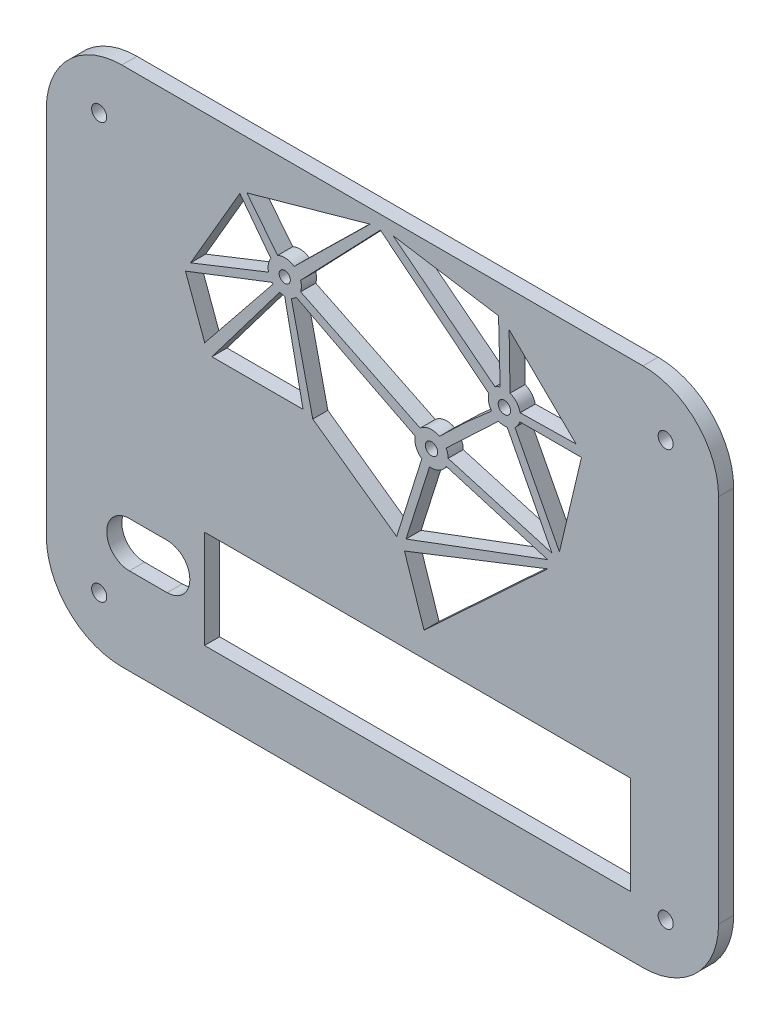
ISO-10303-21;
HEADER;
FILE_DESCRIPTION(('STEP AP214'),'2;1');
FILE_NAME('part.step','',(''),(''),'','','');
FILE_SCHEMA(('AUTOMOTIVE_DESIGN { 1 0 10303 214 1 1 1 1 }'));
ENDSEC;
DATA;
#1=APPLICATION_CONTEXT('core data for automotive mechanical design processes');
#2=APPLICATION_PROTOCOL_DEFINITION('international standard','automotive_design',2000,#1);
#3=PRODUCT_CONTEXT('',#1,'mechanical');
#4=PRODUCT('Part','Part','',(#3));
#5=PRODUCT_RELATED_PRODUCT_CATEGORY('part','',(#4));
#6=PRODUCT_DEFINITION_FORMATION('','',#4);
#7=PRODUCT_DEFINITION_CONTEXT('part definition',#1,'design');
#8=PRODUCT_DEFINITION('design','',#6,#7);
#9=PRODUCT_DEFINITION_SHAPE('','',#8);
#10=(LENGTH_UNIT() NAMED_UNIT(*) SI_UNIT(.MILLI.,.METRE.));
#11=(NAMED_UNIT(*) PLANE_ANGLE_UNIT() SI_UNIT($,.RADIAN.));
#12=(NAMED_UNIT(*) SI_UNIT($,.STERADIAN.) SOLID_ANGLE_UNIT());
#13=UNCERTAINTY_MEASURE_WITH_UNIT(LENGTH_MEASURE(1.E-05),#10,'distance_accuracy_value','');
#14=(GEOMETRIC_REPRESENTATION_CONTEXT(3) GLOBAL_UNCERTAINTY_ASSIGNED_CONTEXT((#13)) GLOBAL_UNIT_ASSIGNED_CONTEXT((#10,
#11,#12)) REPRESENTATION_CONTEXT('',''));
#15=CARTESIAN_POINT('',(0.,0.,0.));
#16=DIRECTION('',(0.,0.,1.));
#17=DIRECTION('',(1.,0.,0.));
#18=AXIS2_PLACEMENT_3D('',#15,#16,#17);
#19=CARTESIAN_POINT('',(0.,0.,-2.));
#20=DIRECTION('',(0.,0.,1.));
#21=DIRECTION('',(1.,0.,0.));
#22=AXIS2_PLACEMENT_3D('',#19,#20,#21);
#23=PLANE('',#22);
#24=CARTESIAN_POINT('',(60.6431749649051,-13.9289308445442,-2.));
#25=DIRECTION('',(0.,0.,1.));
#26=DIRECTION('',(1.,0.,0.));
#27=AXIS2_PLACEMENT_3D('',#24,#25,#26);
#28=CIRCLE('',#27,2.12701087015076);
#29=CARTESIAN_POINT('',(62.6719239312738,-14.5679557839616,-2.));
#30=VERTEX_POINT('',#29);
#31=CARTESIAN_POINT('',(62.038733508,-15.5341073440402,-2.));
#32=VERTEX_POINT('',#31);
#33=EDGE_CURVE('E1198',#30,#32,#28,.F.);
#34=ORIENTED_EDGE('',*,*,#33,.T.);
#35=DIRECTION('',(0.461173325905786,-0.887310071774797,0.));
#36=VECTOR('',#35,1.);
#37=CARTESIAN_POINT('',(42.487668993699,22.0826746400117,-2.));
#38=LINE('',#37,#36);
#39=CARTESIAN_POINT('',(67.9309131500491,-26.8708218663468,-2.));
#40=VERTEX_POINT('',#39);
#41=EDGE_CURVE('E1100',#32,#40,#38,.T.);
#42=ORIENTED_EDGE('',*,*,#41,.T.);
#43=DIRECTION('',(-0.230763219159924,-0.97300993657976,0.));
#44=VECTOR('',#43,1.);
#45=CARTESIAN_POINT('',(70.3469164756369,-16.6837771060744,-2.));
#46=LINE('',#45,#44);
#47=CARTESIAN_POINT('',(70.8487137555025,-14.5679557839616,-2.));
#48=VERTEX_POINT('',#47);
#49=EDGE_CURVE('E1193',#48,#40,#46,.T.);
#50=ORIENTED_EDGE('',*,*,#49,.F.);
#51=DIRECTION('',(1.,0.,0.));
#52=VECTOR('',#51,1.);
#53=CARTESIAN_POINT('',(0.,-14.5679557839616,-2.));
#54=LINE('',#53,#52);
#55=EDGE_CURVE('E1195',#30,#48,#54,.T.);
#56=ORIENTED_EDGE('',*,*,#55,.F.);
#57=EDGE_LOOP('',(#34,#42,#50,#56));
#58=FACE_BOUND('',#57,.T.);
#59=CARTESIAN_POINT('',(60.6431749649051,-13.9289308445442,-2.));
#60=DIRECTION('',(0.,0.,1.));
#61=DIRECTION('',(1.,0.,0.));
#62=AXIS2_PLACEMENT_3D('',#59,#60,#61);
#63=CIRCLE('',#62,2.12701087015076);
#64=CARTESIAN_POINT('',(59.4039765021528,-12.2001849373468,-2.));
#65=VERTEX_POINT('',#64);
#66=CARTESIAN_POINT('',(60.0835732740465,-11.8768535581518,-2.));
#67=VERTEX_POINT('',#66);
#68=EDGE_CURVE('E1102',#65,#67,#63,.F.);
#69=ORIENTED_EDGE('',*,*,#68,.T.);
#70=DIRECTION('',(-0.0264377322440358,0.999650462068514,0.));
#71=VECTOR('',#70,1.);
#72=CARTESIAN_POINT('',(59.7276903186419,1.57961682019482,-2.));
#73=LINE('',#72,#71);
#74=CARTESIAN_POINT('',(59.8706106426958,-3.82441581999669,-2.));
#75=VERTEX_POINT('',#74);
#76=EDGE_CURVE('E1120',#67,#75,#73,.T.);
#77=ORIENTED_EDGE('',*,*,#76,.T.);
#78=DIRECTION('',(0.987676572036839,-0.156508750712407,0.));
#79=VECTOR('',#78,1.);
#80=CARTESIAN_POINT('',(0.875351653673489,5.52406377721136,-2.));
#81=LINE('',#80,#79);
#82=CARTESIAN_POINT('',(45.888987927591,-1.60886635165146,-2.));
#83=VERTEX_POINT('',#82);
#84=EDGE_CURVE('E1096',#83,#75,#81,.T.);
#85=ORIENTED_EDGE('',*,*,#84,.F.);
#86=DIRECTION('',(-0.787098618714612,0.616827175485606,0.));
#87=VECTOR('',#86,1.);
#88=CARTESIAN_POINT('',(16.6785370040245,21.2825471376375,-2.));
#89=LINE('',#88,#87);
#90=EDGE_CURVE('E1099',#65,#83,#89,.T.);
#91=ORIENTED_EDGE('',*,*,#90,.F.);
#92=EDGE_LOOP('',(#69,#77,#85,#91));
#93=FACE_BOUND('',#92,.T.);
#94=CARTESIAN_POINT('',(31.566736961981,-13.5081348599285,-2.));
#95=DIRECTION('',(0.,0.,1.));
#96=DIRECTION('',(1.,0.,0.));
#97=AXIS2_PLACEMENT_3D('',#94,#95,#96);
#98=CIRCLE('',#97,2.20431424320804);
#99=CARTESIAN_POINT('',(29.427775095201,-14.0409044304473,-2.));
#100=VERTEX_POINT('',#99);
#101=CARTESIAN_POINT('',(29.7196623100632,-12.3050901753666,-2.));
#102=VERTEX_POINT('',#101);
#103=EDGE_CURVE('E1373',#100,#102,#98,.F.);
#104=ORIENTED_EDGE('',*,*,#103,.T.);
#105=DIRECTION('',(-0.604697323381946,0.796455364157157,0.));
#106=VECTOR('',#105,1.);
#107=CARTESIAN_POINT('',(12.9260957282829,9.81395297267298,-2.));
#108=LINE('',#107,#106);
#109=CARTESIAN_POINT('',(25.6243568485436,-6.91110565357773,-2.));
#110=VERTEX_POINT('',#109);
#111=EDGE_CURVE('E1391',#102,#110,#108,.T.);
#112=ORIENTED_EDGE('',*,*,#111,.T.);
#113=DIRECTION('',(0.502595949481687,0.864521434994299,0.));
#114=VECTOR('',#113,1.);
#115=CARTESIAN_POINT('',(22.1544851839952,-12.879674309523,-2.));
#116=LINE('',#115,#114);
#117=CARTESIAN_POINT('',(19.1010203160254,-18.1319765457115,-2.));
#118=VERTEX_POINT('',#117);
#119=EDGE_CURVE('E1368',#118,#110,#116,.T.);
#120=ORIENTED_EDGE('',*,*,#119,.F.);
#121=DIRECTION('',(-0.929701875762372,-0.368312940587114,0.));
#122=VECTOR('',#121,1.);
#123=CARTESIAN_POINT('',(8.79991161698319,-22.2128886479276,-2.));
#124=LINE('',#123,#122);
#125=EDGE_CURVE('E1371',#100,#118,#124,.T.);
#126=ORIENTED_EDGE('',*,*,#125,.F.);
#127=EDGE_LOOP('',(#104,#112,#120,#126));
#128=FACE_BOUND('',#127,.T.);
#129=CARTESIAN_POINT('',(31.566736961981,-13.5081348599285,-2.));
#130=DIRECTION('',(0.,0.,1.));
#131=DIRECTION('',(1.,0.,0.));
#132=AXIS2_PLACEMENT_3D('',#129,#130,#131);
#133=CIRCLE('',#132,2.20431424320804);
#134=CARTESIAN_POINT('',(31.5540946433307,-15.7124128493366,-2.));
#135=VERTEX_POINT('',#134);
#136=CARTESIAN_POINT('',(30.8940754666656,-15.6073079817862,-2.));
#137=VERTEX_POINT('',#136);
#138=EDGE_CURVE('E1309',#135,#137,#133,.F.);
#139=ORIENTED_EDGE('',*,*,#138,.T.);
#140=DIRECTION('',(-0.602743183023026,-0.79793524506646,0.));
#141=VECTOR('',#140,1.);
#142=CARTESIAN_POINT('',(27.1766133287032,-20.5286312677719,-2.));
#143=LINE('',#142,#141);
#144=CARTESIAN_POINT('',(21.9198184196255,-27.4877841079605,-2.));
#145=VERTEX_POINT('',#144);
#146=EDGE_CURVE('E1327',#137,#145,#143,.T.);
#147=ORIENTED_EDGE('',*,*,#146,.T.);
#148=DIRECTION('',(-1.,0.,0.));
#149=VECTOR('',#148,1.);
#150=CARTESIAN_POINT('',(0.,-27.4877841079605,-2.));
#151=LINE('',#150,#149);
#152=CARTESIAN_POINT('',(33.9875629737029,-27.4877841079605,-2.));
#153=VERTEX_POINT('',#152);
#154=EDGE_CURVE('E1304',#153,#145,#151,.T.);
#155=ORIENTED_EDGE('',*,*,#154,.F.);
#156=DIRECTION('',(0.202381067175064,-0.979306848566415,0.));
#157=VECTOR('',#156,1.);
#158=CARTESIAN_POINT('',(27.1476061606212,5.61025536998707,-2.));
#159=LINE('',#158,#157);
#160=EDGE_CURVE('E1307',#135,#153,#159,.T.);
#161=ORIENTED_EDGE('',*,*,#160,.F.);
#162=EDGE_LOOP('',(#139,#147,#155,#161));
#163=FACE_BOUND('',#162,.T.);
#164=CARTESIAN_POINT('',(60.6431749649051,-13.9289308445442,-2.));
#165=DIRECTION('',(0.,0.,1.));
#166=DIRECTION('',(1.,0.,0.));
#167=AXIS2_PLACEMENT_3D('',#164,#165,#166);
#168=CIRCLE('',#167,0.820057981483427);
#169=CARTESIAN_POINT('',(61.4632329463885,-13.9289308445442,-2.));
#170=VERTEX_POINT('',#169);
#171=EDGE_CURVE('E2406',#170,#170,#168,.F.);
#172=ORIENTED_EDGE('',*,*,#171,.F.);
#173=EDGE_LOOP('',(#172));
#174=FACE_BOUND('',#173,.T.);
#175=CARTESIAN_POINT('',(50.9928182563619,-23.5023641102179,-2.));
#176=DIRECTION('',(0.,0.,1.));
#177=DIRECTION('',(1.,0.,0.));
#178=AXIS2_PLACEMENT_3D('',#175,#176,#177);
#179=CIRCLE('',#178,0.813320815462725);
#180=CARTESIAN_POINT('',(51.8061390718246,-23.5023641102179,-2.));
#181=VERTEX_POINT('',#180);
#182=EDGE_CURVE('E1020',#181,#181,#179,.F.);
#183=ORIENTED_EDGE('',*,*,#182,.F.);
#184=EDGE_LOOP('',(#183));
#185=FACE_BOUND('',#184,.T.);
#186=CARTESIAN_POINT('',(50.9928182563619,-23.5023641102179,-2.));
#187=DIRECTION('',(0.,0.,1.));
#188=DIRECTION('',(1.,0.,0.));
#189=AXIS2_PLACEMENT_3D('',#186,#187,#188);
#190=CIRCLE('',#189,2.2036027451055);
#191=CARTESIAN_POINT('',(52.9329254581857,-22.4574482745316,-2.));
#192=VERTEX_POINT('',#191);
#193=CARTESIAN_POINT('',(53.1964210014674,-23.5023641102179,-2.));
#194=VERTEX_POINT('',#193);
#195=EDGE_CURVE('E1063',#192,#194,#190,.F.);
#196=ORIENTED_EDGE('',*,*,#195,.T.);
#197=DIRECTION('',(0.960457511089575,-0.278426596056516,0.));
#198=VECTOR('',#197,1.);
#199=CARTESIAN_POINT('',(-2.16107031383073,-7.45480584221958,-2.));
#200=LINE('',#199,#198);
#201=CARTESIAN_POINT('',(66.944484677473,-27.4877841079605,-2.));
#202=VERTEX_POINT('',#201);
#203=EDGE_CURVE('E1084',#194,#202,#200,.T.);
#204=ORIENTED_EDGE('',*,*,#203,.T.);
#205=DIRECTION('',(0.459434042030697,-0.888211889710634,0.));
#206=VECTOR('',#205,1.);
#207=CARTESIAN_POINT('',(41.5967956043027,21.5162442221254,-2.));
#208=LINE('',#207,#206);
#209=CARTESIAN_POINT('',(61.0143956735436,-16.0232971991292,-2.));
#210=VERTEX_POINT('',#209);
#211=EDGE_CURVE('E1054',#210,#202,#208,.T.);
#212=ORIENTED_EDGE('',*,*,#211,.F.);
#213=CARTESIAN_POINT('',(60.6431749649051,-13.9289308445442,-2.));
#214=DIRECTION('',(0.,0.,1.));
#215=DIRECTION('',(1.,0.,0.));
#216=AXIS2_PLACEMENT_3D('',#213,#214,#215);
#217=CIRCLE('',#216,2.12701087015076);
#218=CARTESIAN_POINT('',(59.8706106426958,-15.9106774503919,-2.));
#219=VERTEX_POINT('',#218);
#220=EDGE_CURVE('E1057',#210,#219,#217,.F.);
#221=ORIENTED_EDGE('',*,*,#220,.T.);
#222=DIRECTION('',(-0.727300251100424,-0.686319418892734,0.));
#223=VECTOR('',#222,1.);
#224=CARTESIAN_POINT('',(36.1430921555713,-38.3012330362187,-2.));
#225=LINE('',#224,#223);
#226=EDGE_CURVE('E1060',#219,#192,#225,.T.);
#227=ORIENTED_EDGE('',*,*,#226,.T.);
#228=EDGE_LOOP('',(#196,#204,#212,#221,#227));
#229=FACE_BOUND('',#228,.T.);
#230=CARTESIAN_POINT('',(31.566736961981,-13.5081348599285,-2.));
#231=DIRECTION('',(0.,0.,1.));
#232=DIRECTION('',(1.,0.,0.));
#233=AXIS2_PLACEMENT_3D('',#230,#231,#232);
#234=CIRCLE('',#233,2.20431424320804);
#235=CARTESIAN_POINT('',(30.6178594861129,-11.5185035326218,-2.));
#236=VERTEX_POINT('',#235);
#237=CARTESIAN_POINT('',(32.8106492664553,-11.6883317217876,-2.));
#238=VERTEX_POINT('',#237);
#239=EDGE_CURVE('E1405',#236,#238,#234,.F.);
#240=ORIENTED_EDGE('',*,*,#239,.T.);
#241=DIRECTION('',(0.713394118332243,0.700763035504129,0.));
#242=VECTOR('',#241,1.);
#243=CARTESIAN_POINT('',(21.9555206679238,-22.3512635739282,-2.));
#244=LINE('',#243,#242);
#245=CARTESIAN_POINT('',(42.8575970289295,-1.81927136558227,-2.));
#246=VERTEX_POINT('',#245);
#247=EDGE_CURVE('E1423',#238,#246,#244,.T.);
#248=ORIENTED_EDGE('',*,*,#247,.T.);
#249=DIRECTION('',(-0.962924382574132,-0.269771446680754,0.));
#250=VECTOR('',#249,1.);
#251=CARTESIAN_POINT('',(3.59162284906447,-12.8199676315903,-2.));
#252=LINE('',#251,#250);
#253=CARTESIAN_POINT('',(26.5518335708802,-6.3874695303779,-2.));
#254=VERTEX_POINT('',#253);
#255=EDGE_CURVE('E1400',#246,#254,#252,.T.);
#256=ORIENTED_EDGE('',*,*,#255,.T.);
#257=DIRECTION('',(-0.62107446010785,0.783751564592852,0.));
#258=VECTOR('',#257,1.);
#259=CARTESIAN_POINT('',(13.2006859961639,10.4607241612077,-2.));
#260=LINE('',#259,#258);
#261=EDGE_CURVE('E1403',#236,#254,#260,.T.);
#262=ORIENTED_EDGE('',*,*,#261,.F.);
#263=EDGE_LOOP('',(#240,#248,#256,#262));
#264=FACE_BOUND('',#263,.T.);
#265=DIRECTION('',(0.,1.,0.));
#266=VECTOR('',#265,1.);
#267=CARTESIAN_POINT('',(20.938287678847,-48.0843484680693,-2.));
#268=LINE('',#267,#266);
#269=CARTESIAN_POINT('',(20.938287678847,-61.0843484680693,-2.));
#270=VERTEX_POINT('',#269);
#271=CARTESIAN_POINT('',(20.938287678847,-48.0843484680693,-2.));
#272=VERTEX_POINT('',#271);
#273=EDGE_CURVE('E1435',#270,#272,#268,.T.);
#274=ORIENTED_EDGE('',*,*,#273,.F.);
#275=DIRECTION('',(-1.,0.,0.));
#276=VECTOR('',#275,1.);
#277=CARTESIAN_POINT('',(20.938287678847,-61.0843484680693,-2.));
#278=LINE('',#277,#276);
#279=CARTESIAN_POINT('',(77.3644975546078,-61.0843484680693,-2.));
#280=VERTEX_POINT('',#279);
#281=EDGE_CURVE('E1437',#280,#270,#278,.T.);
#282=ORIENTED_EDGE('',*,*,#281,.F.);
#283=DIRECTION('',(0.,1.,0.));
#284=VECTOR('',#283,1.);
#285=CARTESIAN_POINT('',(77.3644975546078,-48.0843484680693,-2.));
#286=LINE('',#285,#284);
#287=CARTESIAN_POINT('',(77.3644975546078,-48.0843484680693,-2.));
#288=VERTEX_POINT('',#287);
#289=EDGE_CURVE('E1453',#280,#288,#286,.T.);
#290=ORIENTED_EDGE('',*,*,#289,.T.);
#291=DIRECTION('',(-1.,0.,0.));
#292=VECTOR('',#291,1.);
#293=CARTESIAN_POINT('',(20.938287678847,-48.0843484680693,-2.));
#294=LINE('',#293,#292);
#295=EDGE_CURVE('E1432',#288,#272,#294,.T.);
#296=ORIENTED_EDGE('',*,*,#295,.T.);
#297=EDGE_LOOP('',(#274,#282,#290,#296));
#298=FACE_BOUND('',#297,.T.);
#299=DIRECTION('',(1.,0.,0.));
#300=VECTOR('',#299,1.);
#301=CARTESIAN_POINT('',(11.,-51.5,-2.));
#302=LINE('',#301,#300);
#303=CARTESIAN_POINT('',(11.,-51.5,-2.));
#304=VERTEX_POINT('',#303);
#305=CARTESIAN_POINT('',(16.,-51.5,-2.));
#306=VERTEX_POINT('',#305);
#307=EDGE_CURVE('E1464',#304,#306,#302,.T.);
#308=ORIENTED_EDGE('',*,*,#307,.F.);
#309=CARTESIAN_POINT('',(11.,-54.5,-2.));
#310=DIRECTION('',(0.,0.,1.));
#311=DIRECTION('',(1.,0.,0.));
#312=AXIS2_PLACEMENT_3D('',#309,#310,#311);
#313=CIRCLE('',#312,3.);
#314=CARTESIAN_POINT('',(11.,-57.5,-2.));
#315=VERTEX_POINT('',#314);
#316=EDGE_CURVE('E1467',#315,#304,#313,.F.);
#317=ORIENTED_EDGE('',*,*,#316,.F.);
#318=DIRECTION('',(-1.,0.,0.));
#319=VECTOR('',#318,1.);
#320=CARTESIAN_POINT('',(11.,-57.5,-2.));
#321=LINE('',#320,#319);
#322=CARTESIAN_POINT('',(16.,-57.5,-2.));
#323=VERTEX_POINT('',#322);
#324=EDGE_CURVE('E1484',#323,#315,#321,.T.);
#325=ORIENTED_EDGE('',*,*,#324,.F.);
#326=CARTESIAN_POINT('',(16.,-54.5,-2.));
#327=DIRECTION('',(0.,0.,1.));
#328=DIRECTION('',(1.,0.,0.));
#329=AXIS2_PLACEMENT_3D('',#326,#327,#328);
#330=CIRCLE('',#329,3.);
#331=EDGE_CURVE('E1462',#306,#323,#330,.F.);
#332=ORIENTED_EDGE('',*,*,#331,.F.);
#333=EDGE_LOOP('',(#308,#317,#325,#332));
#334=FACE_BOUND('',#333,.T.);
#335=CARTESIAN_POINT('',(79.,-59.,-2.));
#336=DIRECTION('',(0.,0.,1.));
#337=DIRECTION('',(1.,0.,0.));
#338=AXIS2_PLACEMENT_3D('',#335,#336,#337);
#339=CIRCLE('',#338,9.99999999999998);
#340=CARTESIAN_POINT('',(79.,-69.,-2.));
#341=VERTEX_POINT('',#340);
#342=CARTESIAN_POINT('',(89.,-59.,-2.));
#343=VERTEX_POINT('',#342);
#344=EDGE_CURVE('E1494',#341,#343,#339,.T.);
#345=ORIENTED_EDGE('',*,*,#344,.F.);
#346=DIRECTION('',(1.,0.,0.));
#347=VECTOR('',#346,1.);
#348=CARTESIAN_POINT('',(0.,-69.,-2.));
#349=LINE('',#348,#347);
#350=CARTESIAN_POINT('',(10.0000000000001,-69.,-2.));
#351=VERTEX_POINT('',#350);
#352=EDGE_CURVE('E1513',#351,#341,#349,.T.);
#353=ORIENTED_EDGE('',*,*,#352,.F.);
#354=CARTESIAN_POINT('',(10.,-59.,-2.));
#355=DIRECTION('',(0.,0.,1.));
#356=DIRECTION('',(1.,0.,0.));
#357=AXIS2_PLACEMENT_3D('',#354,#355,#356);
#358=CIRCLE('',#357,10.);
#359=CARTESIAN_POINT('',(0.,-58.9999999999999,-2.));
#360=VERTEX_POINT('',#359);
#361=EDGE_CURVE('E1510',#360,#351,#358,.T.);
#362=ORIENTED_EDGE('',*,*,#361,.F.);
#363=DIRECTION('',(0.,-1.,0.));
#364=VECTOR('',#363,1.);
#365=CARTESIAN_POINT('',(0.,0.,-2.));
#366=LINE('',#365,#364);
#367=CARTESIAN_POINT('',(0.,-10.0000000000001,-2.));
#368=VERTEX_POINT('',#367);
#369=EDGE_CURVE('E1507',#368,#360,#366,.T.);
#370=ORIENTED_EDGE('',*,*,#369,.F.);
#371=CARTESIAN_POINT('',(10.,-10.,-2.));
#372=DIRECTION('',(0.,0.,1.));
#373=DIRECTION('',(1.,0.,0.));
#374=AXIS2_PLACEMENT_3D('',#371,#372,#373);
#375=CIRCLE('',#374,10.);
#376=CARTESIAN_POINT('',(10.0000000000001,0.,-2.));
#377=VERTEX_POINT('',#376);
#378=EDGE_CURVE('E1504',#377,#368,#375,.T.);
#379=ORIENTED_EDGE('',*,*,#378,.F.);
#380=DIRECTION('',(1.,0.,0.));
#381=VECTOR('',#380,1.);
#382=CARTESIAN_POINT('',(0.,0.,-2.));
#383=LINE('',#382,#381);
#384=CARTESIAN_POINT('',(79.,0.,-2.));
#385=VERTEX_POINT('',#384);
#386=EDGE_CURVE('E1502',#377,#385,#383,.T.);
#387=ORIENTED_EDGE('',*,*,#386,.T.);
#388=CARTESIAN_POINT('',(79.,-10.,-2.));
#389=DIRECTION('',(0.,0.,1.));
#390=DIRECTION('',(1.,0.,0.));
#391=AXIS2_PLACEMENT_3D('',#388,#389,#390);
#392=CIRCLE('',#391,9.99999999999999);
#393=CARTESIAN_POINT('',(89.,-10.,-2.));
#394=VERTEX_POINT('',#393);
#395=EDGE_CURVE('E1500',#385,#394,#392,.F.);
#396=ORIENTED_EDGE('',*,*,#395,.T.);
#397=DIRECTION('',(0.,-1.,0.));
#398=VECTOR('',#397,1.);
#399=CARTESIAN_POINT('',(89.,0.,-2.));
#400=LINE('',#399,#398);
#401=EDGE_CURVE('E1497',#394,#343,#400,.T.);
#402=ORIENTED_EDGE('',*,*,#401,.T.);
#403=EDGE_LOOP('',(#345,#353,#362,#370,#379,#387,#396,#402));
#404=FACE_BOUND('',#403,.T.);
#405=CARTESIAN_POINT('',(7.,-7.,-2.));
#406=DIRECTION('',(0.,0.,1.));
#407=DIRECTION('',(1.,0.,0.));
#408=AXIS2_PLACEMENT_3D('',#405,#406,#407);
#409=CIRCLE('',#408,1.);
#410=CARTESIAN_POINT('',(8.,-7.,-2.));
#411=VERTEX_POINT('',#410);
#412=EDGE_CURVE('E1516',#411,#411,#409,.T.);
#413=ORIENTED_EDGE('',*,*,#412,.T.);
#414=EDGE_LOOP('',(#413));
#415=FACE_BOUND('',#414,.T.);
#416=CARTESIAN_POINT('',(7.,-62.,-2.));
#417=DIRECTION('',(0.,0.,1.));
#418=DIRECTION('',(1.,0.,0.));
#419=AXIS2_PLACEMENT_3D('',#416,#417,#418);
#420=CIRCLE('',#419,1.);
#421=CARTESIAN_POINT('',(8.,-62.,-2.));
#422=VERTEX_POINT('',#421);
#423=EDGE_CURVE('E1519',#422,#422,#420,.F.);
#424=ORIENTED_EDGE('',*,*,#423,.F.);
#425=EDGE_LOOP('',(#424));
#426=FACE_BOUND('',#425,.T.);
#427=CARTESIAN_POINT('',(82.,-7.00000000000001,-2.));
#428=DIRECTION('',(0.,0.,1.));
#429=DIRECTION('',(1.,0.,0.));
#430=AXIS2_PLACEMENT_3D('',#427,#428,#429);
#431=CIRCLE('',#430,0.999999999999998);
#432=CARTESIAN_POINT('',(83.,-7.00000000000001,-2.));
#433=VERTEX_POINT('',#432);
#434=EDGE_CURVE('E1522',#433,#433,#431,.F.);
#435=ORIENTED_EDGE('',*,*,#434,.F.);
#436=EDGE_LOOP('',(#435));
#437=FACE_BOUND('',#436,.T.);
#438=CARTESIAN_POINT('',(82.,-62.,-2.));
#439=DIRECTION('',(0.,0.,1.));
#440=DIRECTION('',(1.,0.,0.));
#441=AXIS2_PLACEMENT_3D('',#438,#439,#440);
#442=CIRCLE('',#441,0.999999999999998);
#443=CARTESIAN_POINT('',(83.,-62.,-2.));
#444=VERTEX_POINT('',#443);
#445=EDGE_CURVE('E1525',#444,#444,#442,.T.);
#446=ORIENTED_EDGE('',*,*,#445,.T.);
#447=EDGE_LOOP('',(#446));
#448=FACE_BOUND('',#447,.T.);
#449=CARTESIAN_POINT('',(31.566736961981,-13.5081348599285,-2.));
#450=DIRECTION('',(0.,0.,1.));
#451=DIRECTION('',(1.,0.,0.));
#452=AXIS2_PLACEMENT_3D('',#449,#450,#451);
#453=CIRCLE('',#452,0.740460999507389);
#454=CARTESIAN_POINT('',(32.3071979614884,-13.5081348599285,-2.));
#455=VERTEX_POINT('',#454);
#456=EDGE_CURVE('E1008',#455,#455,#453,.F.);
#457=ORIENTED_EDGE('',*,*,#456,.F.);
#458=EDGE_LOOP('',(#457));
#459=FACE_BOUND('',#458,.T.);
#460=DIRECTION('',(0.315546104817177,-0.948910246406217,0.));
#461=VECTOR('',#460,1.);
#462=CARTESIAN_POINT('',(31.6108461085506,10.5117205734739,-2.));
#463=LINE('',#462,#461);
#464=CARTESIAN_POINT('',(47.4144299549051,-37.0128167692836,-2.));
#465=VERTEX_POINT('',#464);
#466=CARTESIAN_POINT('',(50.0027215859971,-44.7963273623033,-2.));
#467=VERTEX_POINT('',#466);
#468=EDGE_CURVE('E997',#465,#467,#463,.T.);
#469=ORIENTED_EDGE('',*,*,#468,.T.);
#470=DIRECTION('',(0.732500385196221,0.680766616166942,0.));
#471=VECTOR('',#470,1.);
#472=CARTESIAN_POINT('',(45.5116382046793,-48.9702222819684,-2.));
#473=LINE('',#472,#471);
#474=CARTESIAN_POINT('',(66.3819495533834,-29.573903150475,-2.));
#475=VERTEX_POINT('',#474);
#476=EDGE_CURVE('E981',#467,#475,#473,.T.);
#477=ORIENTED_EDGE('',*,*,#476,.T.);
#478=DIRECTION('',(-0.930962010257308,-0.365116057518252,0.));
#479=VECTOR('',#478,1.);
#480=CARTESIAN_POINT('',(18.9018012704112,-48.1952479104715,-2.));
#481=LINE('',#480,#479);
#482=EDGE_CURVE('E1004',#475,#465,#481,.T.);
#483=ORIENTED_EDGE('',*,*,#482,.T.);
#484=EDGE_LOOP('',(#469,#477,#483));
#485=FACE_BOUND('',#484,.T.);
#486=CARTESIAN_POINT('',(50.9928182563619,-23.5023641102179,-2.));
#487=DIRECTION('',(0.,0.,1.));
#488=DIRECTION('',(1.,0.,0.));
#489=AXIS2_PLACEMENT_3D('',#486,#487,#488);
#490=CIRCLE('',#489,2.2036027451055);
#491=CARTESIAN_POINT('',(52.9329254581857,-24.5472799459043,-2.));
#492=VERTEX_POINT('',#491);
#493=CARTESIAN_POINT('',(50.736467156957,-25.6910050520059,-2.));
#494=VERTEX_POINT('',#493);
#495=EDGE_CURVE('E1027',#492,#494,#490,.F.);
#496=ORIENTED_EDGE('',*,*,#495,.T.);
#497=DIRECTION('',(-0.301693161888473,-0.953405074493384,0.));
#498=VECTOR('',#497,1.);
#499=CARTESIAN_POINT('',(53.5081492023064,-16.9319874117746,-2.));
#500=LINE('',#499,#498);
#501=CARTESIAN_POINT('',(47.6194938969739,-35.541205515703,-2.));
#502=VERTEX_POINT('',#501);
#503=EDGE_CURVE('E1045',#494,#502,#500,.T.);
#504=ORIENTED_EDGE('',*,*,#503,.T.);
#505=DIRECTION('',(-0.936650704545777,-0.350264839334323,0.));
#506=VECTOR('',#505,1.);
#507=CARTESIAN_POINT('',(17.5024291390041,-46.8036204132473,-2.));
#508=LINE('',#507,#506);
#509=CARTESIAN_POINT('',(66.3819495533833,-28.524898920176,-2.));
#510=VERTEX_POINT('',#509);
#511=EDGE_CURVE('E992',#510,#502,#508,.T.);
#512=ORIENTED_EDGE('',*,*,#511,.F.);
#513=DIRECTION('',(0.958939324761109,-0.283611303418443,0.));
#514=VECTOR('',#513,1.);
#515=CARTESIAN_POINT('',(-2.41834679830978,-8.17685267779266,-2.));
#516=LINE('',#515,#514);
#517=EDGE_CURVE('E1025',#492,#510,#516,.T.);
#518=ORIENTED_EDGE('',*,*,#517,.F.);
#519=EDGE_LOOP('',(#496,#504,#512,#518));
#520=FACE_BOUND('',#519,.T.);
#521=CARTESIAN_POINT('',(50.9928182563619,-23.5023641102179,-2.));
#522=DIRECTION('',(0.,0.,1.));
#523=DIRECTION('',(1.,0.,0.));
#524=AXIS2_PLACEMENT_3D('',#521,#522,#523);
#525=CIRCLE('',#524,2.2036027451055);
#526=CARTESIAN_POINT('',(49.7127255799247,-25.296027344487,-2.));
#527=VERTEX_POINT('',#526);
#528=CARTESIAN_POINT('',(48.8219724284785,-23.123822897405,-2.));
#529=VERTEX_POINT('',#528);
#530=EDGE_CURVE('E1262',#527,#529,#525,.F.);
#531=ORIENTED_EDGE('',*,*,#530,.T.);
#532=DIRECTION('',(-0.892141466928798,0.451756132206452,0.));
#533=VECTOR('',#532,1.);
#534=CARTESIAN_POINT('',(0.644160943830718,1.27210822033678,-2.));
#535=LINE('',#534,#533);
#536=CARTESIAN_POINT('',(39.6704155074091,-18.489723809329,-2.));
#537=VERTEX_POINT('',#536);
#538=EDGE_CURVE('E1289',#529,#537,#535,.T.);
#539=ORIENTED_EDGE('',*,*,#538,.T.);
#540=DIRECTION('',(0.888157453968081,-0.459539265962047,0.));
#541=VECTOR('',#540,1.);
#542=CARTESIAN_POINT('',(0.830997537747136,1.60607963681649,-2.));
#543=LINE('',#542,#541);
#544=CARTESIAN_POINT('',(33.101139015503,-15.0907313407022,-2.));
#545=VERTEX_POINT('',#544);
#546=EDGE_CURVE('E1192',#545,#537,#543,.T.);
#547=ORIENTED_EDGE('',*,*,#546,.F.);
#548=CARTESIAN_POINT('',(31.566736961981,-13.5081348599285,-2.));
#549=DIRECTION('',(0.,0.,1.));
#550=DIRECTION('',(1.,0.,0.));
#551=AXIS2_PLACEMENT_3D('',#548,#549,#550);
#552=CIRCLE('',#551,2.20431424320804);
#553=CARTESIAN_POINT('',(32.4353201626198,-15.5341073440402,-2.));
#554=VERTEX_POINT('',#553);
#555=EDGE_CURVE('E1253',#545,#554,#552,.F.);
#556=ORIENTED_EDGE('',*,*,#555,.T.);
#557=DIRECTION('',(-0.22279154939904,0.974866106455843,0.));
#558=VECTOR('',#557,1.);
#559=CARTESIAN_POINT('',(27.4514754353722,6.27363768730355,-2.));
#560=LINE('',#559,#558);
#561=CARTESIAN_POINT('',(35.273577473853,-27.9534332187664,-2.));
#562=VERTEX_POINT('',#561);
#563=EDGE_CURVE('E1256',#562,#554,#560,.T.);
#564=ORIENTED_EDGE('',*,*,#563,.F.);
#565=DIRECTION('',(-0.814127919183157,0.58068557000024,0.));
#566=VECTOR('',#565,1.);
#567=CARTESIAN_POINT('',(-1.32095107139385,-1.85198875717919,-2.));
#568=LINE('',#567,#566);
#569=CARTESIAN_POINT('',(46.3810583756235,-35.8759644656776,-2.));
#570=VERTEX_POINT('',#569);
#571=EDGE_CURVE('E1258',#570,#562,#568,.T.);
#572=ORIENTED_EDGE('',*,*,#571,.F.);
#573=DIRECTION('',(-0.300363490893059,-0.953824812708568,0.));
#574=VECTOR('',#573,1.);
#575=CARTESIAN_POINT('',(52.4748954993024,-16.5245678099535,-2.));
#576=LINE('',#575,#574);
#577=EDGE_CURVE('E1260',#527,#570,#576,.T.);
#578=ORIENTED_EDGE('',*,*,#577,.F.);
#579=EDGE_LOOP('',(#531,#539,#547,#556,#564,#572,#578));
#580=FACE_BOUND('',#579,.T.);
#581=CARTESIAN_POINT('',(31.566736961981,-13.5081348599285,-2.));
#582=DIRECTION('',(0.,0.,1.));
#583=DIRECTION('',(1.,0.,0.));
#584=AXIS2_PLACEMENT_3D('',#581,#582,#583);
#585=CIRCLE('',#584,2.20431424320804);
#586=CARTESIAN_POINT('',(30.0323349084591,-15.0907313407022,-2.));
#587=VERTEX_POINT('',#586);
#588=CARTESIAN_POINT('',(29.9148517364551,-14.967681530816,-2.));
#589=VERTEX_POINT('',#588);
#590=EDGE_CURVE('E1341',#587,#589,#585,.F.);
#591=ORIENTED_EDGE('',*,*,#590,.T.);
#592=DIRECTION('',(-0.932529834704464,-0.361092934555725,0.));
#593=VECTOR('',#592,1.);
#594=CARTESIAN_POINT('',(8.94060732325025,-23.0892999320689,-2.));
#595=LINE('',#594,#593);
#596=CARTESIAN_POINT('',(18.4210836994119,-19.4182827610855,-2.));
#597=VERTEX_POINT('',#596);
#598=EDGE_CURVE('E1359',#589,#597,#595,.T.);
#599=ORIENTED_EDGE('',*,*,#598,.T.);
#600=DIRECTION('',(-0.34461048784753,0.938745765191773,0.));
#601=VECTOR('',#600,1.);
#602=CARTESIAN_POINT('',(9.95161608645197,3.65320558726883,-2.));
#603=LINE('',#602,#601);
#604=CARTESIAN_POINT('',(20.9712759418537,-26.365204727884,-2.));
#605=VERTEX_POINT('',#604);
#606=EDGE_CURVE('E1336',#605,#597,#603,.T.);
#607=ORIENTED_EDGE('',*,*,#606,.F.);
#608=DIRECTION('',(-0.626442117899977,-0.779467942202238,0.));
#609=VECTOR('',#608,1.);
#610=CARTESIAN_POINT('',(25.6154304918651,-20.5865869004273,-2.));
#611=LINE('',#610,#609);
#612=EDGE_CURVE('E1339',#587,#605,#611,.T.);
#613=ORIENTED_EDGE('',*,*,#612,.F.);
#614=EDGE_LOOP('',(#591,#599,#607,#613));
#615=FACE_BOUND('',#614,.T.);
#616=CARTESIAN_POINT('',(50.9928182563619,-23.5023641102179,-2.));
#617=DIRECTION('',(0.,0.,1.));
#618=DIRECTION('',(1.,0.,0.));
#619=AXIS2_PLACEMENT_3D('',#616,#617,#618);
#620=CIRCLE('',#619,2.2036027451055);
#621=CARTESIAN_POINT('',(49.4921092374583,-21.8887540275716,-2.));
#622=VERTEX_POINT('',#621);
#623=CARTESIAN_POINT('',(52.0361159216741,-21.5613862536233,-2.));
#624=VERTEX_POINT('',#623);
#625=EDGE_CURVE('E1145',#622,#624,#620,.F.);
#626=ORIENTED_EDGE('',*,*,#625,.T.);
#627=DIRECTION('',(0.720552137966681,0.693400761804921,0.));
#628=VECTOR('',#627,1.);
#629=CARTESIAN_POINT('',(35.7919503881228,-37.1934497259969,-2.));
#630=LINE('',#629,#628);
#631=CARTESIAN_POINT('',(55.4908028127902,-18.2368766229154,-2.));
#632=VERTEX_POINT('',#631);
#633=EDGE_CURVE('E1175',#624,#632,#630,.T.);
#634=ORIENTED_EDGE('',*,*,#633,.T.);
#635=DIRECTION('',(-0.751195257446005,-0.660080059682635,0.));
#636=VECTOR('',#635,1.);
#637=CARTESIAN_POINT('',(33.2203954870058,-37.8060254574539,-2.));
#638=LINE('',#637,#636);
#639=CARTESIAN_POINT('',(58.9413544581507,-15.2048549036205,-2.));
#640=VERTEX_POINT('',#639);
#641=EDGE_CURVE('E1129',#640,#632,#638,.T.);
#642=ORIENTED_EDGE('',*,*,#641,.F.);
#643=CARTESIAN_POINT('',(60.6431749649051,-13.9289308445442,-2.));
#644=DIRECTION('',(0.,0.,1.));
#645=DIRECTION('',(1.,0.,0.));
#646=AXIS2_PLACEMENT_3D('',#643,#644,#645);
#647=CIRCLE('',#646,2.12701087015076);
#648=CARTESIAN_POINT('',(58.5869902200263,-13.3846151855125,-2.));
#649=VERTEX_POINT('',#648);
#650=EDGE_CURVE('E1132',#640,#649,#647,.F.);
#651=ORIENTED_EDGE('',*,*,#650,.T.);
#652=DIRECTION('',(-0.778853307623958,0.627206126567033,0.));
#653=VECTOR('',#652,1.);
#654=CARTESIAN_POINT('',(16.5089856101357,20.5005619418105,-2.));
#655=LINE('',#654,#653);
#656=CARTESIAN_POINT('',(44.2253538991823,-1.81927136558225,-2.));
#657=VERTEX_POINT('',#656);
#658=EDGE_CURVE('E1135',#649,#657,#655,.T.);
#659=ORIENTED_EDGE('',*,*,#658,.T.);
#660=DIRECTION('',(0.691667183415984,0.722216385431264,0.));
#661=VECTOR('',#660,1.);
#662=CARTESIAN_POINT('',(23.9765768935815,-22.9623859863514,-2.));
#663=LINE('',#662,#661);
#664=CARTESIAN_POINT('',(33.6682110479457,-12.8426966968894,-2.));
#665=VERTEX_POINT('',#664);
#666=EDGE_CURVE('E1138',#665,#657,#663,.T.);
#667=ORIENTED_EDGE('',*,*,#666,.F.);
#668=CARTESIAN_POINT('',(31.566736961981,-13.5081348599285,-2.));
#669=DIRECTION('',(0.,0.,1.));
#670=DIRECTION('',(1.,0.,0.));
#671=AXIS2_PLACEMENT_3D('',#668,#669,#670);
#672=CIRCLE('',#671,2.20431424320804);
#673=CARTESIAN_POINT('',(33.6682110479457,-14.1735730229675,-2.));
#674=VERTEX_POINT('',#673);
#675=EDGE_CURVE('E1140',#665,#674,#672,.F.);
#676=ORIENTED_EDGE('',*,*,#675,.T.);
#677=DIRECTION('',(-0.898853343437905,0.438249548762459,0.));
#678=VECTOR('',#677,1.);
#679=CARTESIAN_POINT('',(0.883123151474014,1.81129267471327,-2.));
#680=LINE('',#679,#678);
#681=EDGE_CURVE('E1143',#622,#674,#680,.T.);
#682=ORIENTED_EDGE('',*,*,#681,.F.);
#683=EDGE_LOOP('',(#626,#634,#642,#651,#659,#667,#676,#682));
#684=FACE_BOUND('',#683,.T.);
#685=CARTESIAN_POINT('',(60.6431749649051,-13.9289308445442,-2.));
#686=DIRECTION('',(0.,0.,1.));
#687=DIRECTION('',(1.,0.,0.));
#688=AXIS2_PLACEMENT_3D('',#685,#686,#687);
#689=CIRCLE('',#688,2.12701087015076);
#690=CARTESIAN_POINT('',(61.3906796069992,-11.9375966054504,-2.));
#691=VERTEX_POINT('',#690);
#692=CARTESIAN_POINT('',(62.728146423,-13.5081348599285,-2.));
#693=VERTEX_POINT('',#692);
#694=EDGE_CURVE('E1226',#691,#693,#689,.F.);
#695=ORIENTED_EDGE('',*,*,#694,.T.);
#696=DIRECTION('',(0.999861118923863,0.0166656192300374,0.));
#697=VECTOR('',#696,1.);
#698=CARTESIAN_POINT('',(0.242512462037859,-14.5496412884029,-2.));
#699=LINE('',#698,#697);
#700=CARTESIAN_POINT('',(70.1387633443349,-13.3846151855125,-2.));
#701=VERTEX_POINT('',#700);
#702=EDGE_CURVE('E1196',#693,#701,#699,.T.);
#703=ORIENTED_EDGE('',*,*,#702,.T.);
#704=DIRECTION('',(0.714426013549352,-0.699710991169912,0.));
#705=VECTOR('',#704,1.);
#706=CARTESIAN_POINT('',(27.6487623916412,28.2302198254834,-2.));
#707=LINE('',#706,#705);
#708=CARTESIAN_POINT('',(61.2700195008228,-4.69854073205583,-2.));
#709=VERTEX_POINT('',#708);
#710=EDGE_CURVE('E1095',#709,#701,#707,.T.);
#711=ORIENTED_EDGE('',*,*,#710,.F.);
#712=DIRECTION('',(-0.0166656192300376,0.999861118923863,0.));
#713=VECTOR('',#712,1.);
#714=CARTESIAN_POINT('',(61.1747089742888,1.01965601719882,-2.));
#715=LINE('',#714,#713);
#716=EDGE_CURVE('E1224',#691,#709,#715,.T.);
#717=ORIENTED_EDGE('',*,*,#716,.F.);
#718=EDGE_LOOP('',(#695,#703,#711,#717));
#719=FACE_BOUND('',#718,.T.);
#720=ADVANCED_FACE('F537',(#58,#93,#128,#163,#174,#185,#229,#264,#298,#334,#404,#415,#426,#437,
#448,#459,#485,#520,#580,#615,#684,#719),#23,.F.);
#721=CARTESIAN_POINT('',(0.,0.,0.));
#722=DIRECTION('',(0.,0.,1.));
#723=DIRECTION('',(1.,0.,0.));
#724=AXIS2_PLACEMENT_3D('',#721,#722,#723);
#725=PLANE('',#724);
#726=CARTESIAN_POINT('',(60.6431749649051,-13.9289308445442,0.));
#727=DIRECTION('',(0.,0.,1.));
#728=DIRECTION('',(1.,0.,0.));
#729=AXIS2_PLACEMENT_3D('',#726,#727,#728);
#730=CIRCLE('',#729,0.820057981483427);
#731=CARTESIAN_POINT('',(61.4632329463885,-13.9289308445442,0.));
#732=VERTEX_POINT('',#731);
#733=EDGE_CURVE('E2443',#732,#732,#730,.T.);
#734=ORIENTED_EDGE('',*,*,#733,.F.);
#735=EDGE_LOOP('',(#734));
#736=FACE_BOUND('',#735,.T.);
#737=CARTESIAN_POINT('',(50.9928182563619,-23.5023641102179,0.));
#738=DIRECTION('',(0.,0.,1.));
#739=DIRECTION('',(1.,0.,0.));
#740=AXIS2_PLACEMENT_3D('',#737,#738,#739);
#741=CIRCLE('',#740,0.813320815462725);
#742=CARTESIAN_POINT('',(51.8061390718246,-23.5023641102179,0.));
#743=VERTEX_POINT('',#742);
#744=EDGE_CURVE('E2438',#743,#743,#741,.T.);
#745=ORIENTED_EDGE('',*,*,#744,.F.);
#746=EDGE_LOOP('',(#745));
#747=FACE_BOUND('',#746,.T.);
#748=CARTESIAN_POINT('',(31.566736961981,-13.5081348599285,0.));
#749=DIRECTION('',(0.,0.,1.));
#750=DIRECTION('',(1.,0.,0.));
#751=AXIS2_PLACEMENT_3D('',#748,#749,#750);
#752=CIRCLE('',#751,0.740460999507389);
#753=CARTESIAN_POINT('',(32.3071979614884,-13.5081348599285,0.));
#754=VERTEX_POINT('',#753);
#755=EDGE_CURVE('E1017',#754,#754,#752,.T.);
#756=ORIENTED_EDGE('',*,*,#755,.F.);
#757=EDGE_LOOP('',(#756));
#758=FACE_BOUND('',#757,.T.);
#759=DIRECTION('',(1.,0.,0.));
#760=VECTOR('',#759,1.);
#761=CARTESIAN_POINT('',(20.938287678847,-61.0843484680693,0.));
#762=LINE('',#761,#760);
#763=CARTESIAN_POINT('',(20.938287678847,-61.0843484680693,0.));
#764=VERTEX_POINT('',#763);
#765=CARTESIAN_POINT('',(77.3644975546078,-61.0843484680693,0.));
#766=VERTEX_POINT('',#765);
#767=EDGE_CURVE('E1439',#764,#766,#762,.T.);
#768=ORIENTED_EDGE('',*,*,#767,.F.);
#769=DIRECTION('',(0.,-1.,0.));
#770=VECTOR('',#769,1.);
#771=CARTESIAN_POINT('',(20.938287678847,-48.0843484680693,0.));
#772=LINE('',#771,#770);
#773=CARTESIAN_POINT('',(20.938287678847,-48.0843484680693,0.));
#774=VERTEX_POINT('',#773);
#775=EDGE_CURVE('E1447',#774,#764,#772,.T.);
#776=ORIENTED_EDGE('',*,*,#775,.F.);
#777=DIRECTION('',(1.,0.,0.));
#778=VECTOR('',#777,1.);
#779=CARTESIAN_POINT('',(20.938287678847,-48.0843484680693,0.));
#780=LINE('',#779,#778);
#781=CARTESIAN_POINT('',(77.3644975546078,-48.0843484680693,0.));
#782=VERTEX_POINT('',#781);
#783=EDGE_CURVE('E1444',#774,#782,#780,.T.);
#784=ORIENTED_EDGE('',*,*,#783,.T.);
#785=DIRECTION('',(0.,-1.,0.));
#786=VECTOR('',#785,1.);
#787=CARTESIAN_POINT('',(77.3644975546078,-48.0843484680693,0.));
#788=LINE('',#787,#786);
#789=EDGE_CURVE('E1441',#782,#766,#788,.T.);
#790=ORIENTED_EDGE('',*,*,#789,.T.);
#791=EDGE_LOOP('',(#768,#776,#784,#790));
#792=FACE_BOUND('',#791,.T.);
#793=CARTESIAN_POINT('',(11.,-54.5,0.));
#794=DIRECTION('',(0.,0.,1.));
#795=DIRECTION('',(1.,0.,0.));
#796=AXIS2_PLACEMENT_3D('',#793,#794,#795);
#797=CIRCLE('',#796,3.);
#798=CARTESIAN_POINT('',(11.,-51.5,0.));
#799=VERTEX_POINT('',#798);
#800=CARTESIAN_POINT('',(11.,-57.5,0.));
#801=VERTEX_POINT('',#800);
#802=EDGE_CURVE('E1470',#799,#801,#797,.T.);
#803=ORIENTED_EDGE('',*,*,#802,.F.);
#804=DIRECTION('',(-1.,0.,0.));
#805=VECTOR('',#804,1.);
#806=CARTESIAN_POINT('',(11.,-51.5,0.));
#807=LINE('',#806,#805);
#808=CARTESIAN_POINT('',(16.,-51.5,0.));
#809=VERTEX_POINT('',#808);
#810=EDGE_CURVE('E1478',#809,#799,#807,.T.);
#811=ORIENTED_EDGE('',*,*,#810,.F.);
#812=CARTESIAN_POINT('',(16.,-54.5,0.));
#813=DIRECTION('',(0.,0.,1.));
#814=DIRECTION('',(1.,0.,0.));
#815=AXIS2_PLACEMENT_3D('',#812,#813,#814);
#816=CIRCLE('',#815,3.);
#817=CARTESIAN_POINT('',(16.,-57.5,0.));
#818=VERTEX_POINT('',#817);
#819=EDGE_CURVE('E1475',#818,#809,#816,.T.);
#820=ORIENTED_EDGE('',*,*,#819,.F.);
#821=DIRECTION('',(1.,0.,0.));
#822=VECTOR('',#821,1.);
#823=CARTESIAN_POINT('',(11.,-57.5,0.));
#824=LINE('',#823,#822);
#825=EDGE_CURVE('E1472',#801,#818,#824,.T.);
#826=ORIENTED_EDGE('',*,*,#825,.F.);
#827=EDGE_LOOP('',(#803,#811,#820,#826));
#828=FACE_BOUND('',#827,.T.);
#829=CARTESIAN_POINT('',(79.,-59.,0.));
#830=DIRECTION('',(0.,0.,1.));
#831=DIRECTION('',(1.,0.,0.));
#832=AXIS2_PLACEMENT_3D('',#829,#830,#831);
#833=CIRCLE('',#832,9.99999999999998);
#834=CARTESIAN_POINT('',(79.,-69.,0.));
#835=VERTEX_POINT('',#834);
#836=CARTESIAN_POINT('',(89.,-59.,0.));
#837=VERTEX_POINT('',#836);
#838=EDGE_CURVE('E1493',#835,#837,#833,.T.);
#839=ORIENTED_EDGE('',*,*,#838,.T.);
#840=DIRECTION('',(0.,-1.,0.));
#841=VECTOR('',#840,1.);
#842=CARTESIAN_POINT('',(89.,0.,0.));
#843=LINE('',#842,#841);
#844=CARTESIAN_POINT('',(89.,-10.,0.));
#845=VERTEX_POINT('',#844);
#846=EDGE_CURVE('E1530',#845,#837,#843,.T.);
#847=ORIENTED_EDGE('',*,*,#846,.F.);
#848=CARTESIAN_POINT('',(79.,-10.,0.));
#849=DIRECTION('',(0.,0.,1.));
#850=DIRECTION('',(1.,0.,0.));
#851=AXIS2_PLACEMENT_3D('',#848,#849,#850);
#852=CIRCLE('',#851,9.99999999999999);
#853=CARTESIAN_POINT('',(79.,0.,0.));
#854=VERTEX_POINT('',#853);
#855=EDGE_CURVE('E1533',#854,#845,#852,.F.);
#856=ORIENTED_EDGE('',*,*,#855,.F.);
#857=DIRECTION('',(1.,0.,0.));
#858=VECTOR('',#857,1.);
#859=CARTESIAN_POINT('',(0.,0.,0.));
#860=LINE('',#859,#858);
#861=CARTESIAN_POINT('',(10.0000000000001,0.,0.));
#862=VERTEX_POINT('',#861);
#863=EDGE_CURVE('E1535',#862,#854,#860,.T.);
#864=ORIENTED_EDGE('',*,*,#863,.F.);
#865=CARTESIAN_POINT('',(10.,-10.,0.));
#866=DIRECTION('',(0.,0.,1.));
#867=DIRECTION('',(1.,0.,0.));
#868=AXIS2_PLACEMENT_3D('',#865,#866,#867);
#869=CIRCLE('',#868,10.);
#870=CARTESIAN_POINT('',(0.,-10.0000000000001,0.));
#871=VERTEX_POINT('',#870);
#872=EDGE_CURVE('E1537',#862,#871,#869,.T.);
#873=ORIENTED_EDGE('',*,*,#872,.T.);
#874=DIRECTION('',(0.,-1.,0.));
#875=VECTOR('',#874,1.);
#876=CARTESIAN_POINT('',(0.,0.,0.));
#877=LINE('',#876,#875);
#878=CARTESIAN_POINT('',(0.,-58.9999999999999,0.));
#879=VERTEX_POINT('',#878);
#880=EDGE_CURVE('E1540',#871,#879,#877,.T.);
#881=ORIENTED_EDGE('',*,*,#880,.T.);
#882=CARTESIAN_POINT('',(10.,-59.,0.));
#883=DIRECTION('',(0.,0.,1.));
#884=DIRECTION('',(1.,0.,0.));
#885=AXIS2_PLACEMENT_3D('',#882,#883,#884);
#886=CIRCLE('',#885,10.);
#887=CARTESIAN_POINT('',(10.0000000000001,-69.,0.));
#888=VERTEX_POINT('',#887);
#889=EDGE_CURVE('E1543',#879,#888,#886,.T.);
#890=ORIENTED_EDGE('',*,*,#889,.T.);
#891=DIRECTION('',(1.,0.,0.));
#892=VECTOR('',#891,1.);
#893=CARTESIAN_POINT('',(0.,-69.,0.));
#894=LINE('',#893,#892);
#895=EDGE_CURVE('E1546',#888,#835,#894,.T.);
#896=ORIENTED_EDGE('',*,*,#895,.T.);
#897=EDGE_LOOP('',(#839,#847,#856,#864,#873,#881,#890,#896));
#898=FACE_BOUND('',#897,.T.);
#899=CARTESIAN_POINT('',(7.,-7.,0.));
#900=DIRECTION('',(0.,0.,1.));
#901=DIRECTION('',(1.,0.,0.));
#902=AXIS2_PLACEMENT_3D('',#899,#900,#901);
#903=CIRCLE('',#902,1.);
#904=CARTESIAN_POINT('',(8.,-7.,0.));
#905=VERTEX_POINT('',#904);
#906=EDGE_CURVE('E1549',#905,#905,#903,.T.);
#907=ORIENTED_EDGE('',*,*,#906,.F.);
#908=EDGE_LOOP('',(#907));
#909=FACE_BOUND('',#908,.T.);
#910=CARTESIAN_POINT('',(7.,-62.,0.));
#911=DIRECTION('',(0.,0.,1.));
#912=DIRECTION('',(1.,0.,0.));
#913=AXIS2_PLACEMENT_3D('',#910,#911,#912);
#914=CIRCLE('',#913,1.);
#915=CARTESIAN_POINT('',(8.,-62.,0.));
#916=VERTEX_POINT('',#915);
#917=EDGE_CURVE('E1552',#916,#916,#914,.F.);
#918=ORIENTED_EDGE('',*,*,#917,.T.);
#919=EDGE_LOOP('',(#918));
#920=FACE_BOUND('',#919,.T.);
#921=CARTESIAN_POINT('',(82.,-7.00000000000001,0.));
#922=DIRECTION('',(0.,0.,1.));
#923=DIRECTION('',(1.,0.,0.));
#924=AXIS2_PLACEMENT_3D('',#921,#922,#923);
#925=CIRCLE('',#924,0.999999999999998);
#926=CARTESIAN_POINT('',(83.,-7.00000000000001,0.));
#927=VERTEX_POINT('',#926);
#928=EDGE_CURVE('E1555',#927,#927,#925,.F.);
#929=ORIENTED_EDGE('',*,*,#928,.T.);
#930=EDGE_LOOP('',(#929));
#931=FACE_BOUND('',#930,.T.);
#932=CARTESIAN_POINT('',(82.,-62.,0.));
#933=DIRECTION('',(0.,0.,1.));
#934=DIRECTION('',(1.,0.,0.));
#935=AXIS2_PLACEMENT_3D('',#932,#933,#934);
#936=CIRCLE('',#935,0.999999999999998);
#937=CARTESIAN_POINT('',(83.,-62.,0.));
#938=VERTEX_POINT('',#937);
#939=EDGE_CURVE('E1498',#938,#938,#936,.T.);
#940=ORIENTED_EDGE('',*,*,#939,.F.);
#941=EDGE_LOOP('',(#940));
#942=FACE_BOUND('',#941,.T.);
#943=DIRECTION('',(-0.713394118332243,-0.700763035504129,0.));
#944=VECTOR('',#943,1.);
#945=CARTESIAN_POINT('',(21.9555206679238,-22.3512635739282,0.));
#946=LINE('',#945,#944);
#947=CARTESIAN_POINT('',(42.8575970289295,-1.81927136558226,0.));
#948=VERTEX_POINT('',#947);
#949=CARTESIAN_POINT('',(32.8106492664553,-11.6883317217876,0.));
#950=VERTEX_POINT('',#949);
#951=EDGE_CURVE('E1411',#948,#950,#946,.T.);
#952=ORIENTED_EDGE('',*,*,#951,.T.);
#953=CARTESIAN_POINT('',(31.566736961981,-13.5081348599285,0.));
#954=DIRECTION('',(0.,0.,1.));
#955=DIRECTION('',(1.,0.,0.));
#956=AXIS2_PLACEMENT_3D('',#953,#954,#955);
#957=CIRCLE('',#956,2.20431424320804);
#958=CARTESIAN_POINT('',(30.6178594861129,-11.5185035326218,0.));
#959=VERTEX_POINT('',#958);
#960=EDGE_CURVE('E1408',#950,#959,#957,.T.);
#961=ORIENTED_EDGE('',*,*,#960,.T.);
#962=DIRECTION('',(0.62107446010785,-0.783751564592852,0.));
#963=VECTOR('',#962,1.);
#964=CARTESIAN_POINT('',(13.2006859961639,10.4607241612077,0.));
#965=LINE('',#964,#963);
#966=CARTESIAN_POINT('',(26.5518335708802,-6.3874695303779,0.));
#967=VERTEX_POINT('',#966);
#968=EDGE_CURVE('E1417',#967,#959,#965,.T.);
#969=ORIENTED_EDGE('',*,*,#968,.F.);
#970=DIRECTION('',(0.962924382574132,0.269771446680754,0.));
#971=VECTOR('',#970,1.);
#972=CARTESIAN_POINT('',(3.59162284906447,-12.8199676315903,0.));
#973=LINE('',#972,#971);
#974=EDGE_CURVE('E1414',#967,#948,#973,.T.);
#975=ORIENTED_EDGE('',*,*,#974,.T.);
#976=EDGE_LOOP('',(#952,#961,#969,#975));
#977=FACE_BOUND('',#976,.T.);
#978=DIRECTION('',(-0.732500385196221,-0.680766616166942,0.));
#979=VECTOR('',#978,1.);
#980=CARTESIAN_POINT('',(45.5116382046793,-48.9702222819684,0.));
#981=LINE('',#980,#979);
#982=CARTESIAN_POINT('',(66.3819495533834,-29.573903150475,0.));
#983=VERTEX_POINT('',#982);
#984=CARTESIAN_POINT('',(50.0027215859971,-44.7963273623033,0.));
#985=VERTEX_POINT('',#984);
#986=EDGE_CURVE('E1006',#983,#985,#981,.T.);
#987=ORIENTED_EDGE('',*,*,#986,.T.);
#988=DIRECTION('',(-0.315546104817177,0.948910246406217,0.));
#989=VECTOR('',#988,1.);
#990=CARTESIAN_POINT('',(31.6108461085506,10.5117205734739,0.));
#991=LINE('',#990,#989);
#992=CARTESIAN_POINT('',(47.4144299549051,-37.0128167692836,0.));
#993=VERTEX_POINT('',#992);
#994=EDGE_CURVE('E1000',#985,#993,#991,.T.);
#995=ORIENTED_EDGE('',*,*,#994,.T.);
#996=DIRECTION('',(0.930962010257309,0.365116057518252,0.));
#997=VECTOR('',#996,1.);
#998=CARTESIAN_POINT('',(18.9018012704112,-48.1952479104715,0.));
#999=LINE('',#998,#997);
#1000=EDGE_CURVE('E1001',#993,#983,#999,.T.);
#1001=ORIENTED_EDGE('',*,*,#1000,.T.);
#1002=EDGE_LOOP('',(#987,#995,#1001));
#1003=FACE_BOUND('',#1002,.T.);
#1004=DIRECTION('',(-0.960457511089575,0.278426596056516,0.));
#1005=VECTOR('',#1004,1.);
#1006=CARTESIAN_POINT('',(-2.16107031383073,-7.45480584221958,0.));
#1007=LINE('',#1006,#1005);
#1008=CARTESIAN_POINT('',(66.944484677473,-27.4877841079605,0.));
#1009=VERTEX_POINT('',#1008);
#1010=CARTESIAN_POINT('',(53.1964210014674,-23.5023641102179,0.));
#1011=VERTEX_POINT('',#1010);
#1012=EDGE_CURVE('E1069',#1009,#1011,#1007,.T.);
#1013=ORIENTED_EDGE('',*,*,#1012,.T.);
#1014=CARTESIAN_POINT('',(50.9928182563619,-23.5023641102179,0.));
#1015=DIRECTION('',(0.,0.,1.));
#1016=DIRECTION('',(1.,0.,0.));
#1017=AXIS2_PLACEMENT_3D('',#1014,#1015,#1016);
#1018=CIRCLE('',#1017,2.2036027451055);
#1019=CARTESIAN_POINT('',(52.9329254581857,-22.4574482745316,0.));
#1020=VERTEX_POINT('',#1019);
#1021=EDGE_CURVE('E1066',#1011,#1020,#1018,.T.);
#1022=ORIENTED_EDGE('',*,*,#1021,.T.);
#1023=DIRECTION('',(0.727300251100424,0.686319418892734,0.));
#1024=VECTOR('',#1023,1.);
#1025=CARTESIAN_POINT('',(36.1430921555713,-38.3012330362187,0.));
#1026=LINE('',#1025,#1024);
#1027=CARTESIAN_POINT('',(59.8706106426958,-15.9106774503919,0.));
#1028=VERTEX_POINT('',#1027);
#1029=EDGE_CURVE('E1078',#1020,#1028,#1026,.T.);
#1030=ORIENTED_EDGE('',*,*,#1029,.T.);
#1031=CARTESIAN_POINT('',(60.6431749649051,-13.9289308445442,0.));
#1032=DIRECTION('',(0.,0.,1.));
#1033=DIRECTION('',(1.,0.,0.));
#1034=AXIS2_PLACEMENT_3D('',#1031,#1032,#1033);
#1035=CIRCLE('',#1034,2.12701087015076);
#1036=CARTESIAN_POINT('',(61.0143956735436,-16.0232971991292,0.));
#1037=VERTEX_POINT('',#1036);
#1038=EDGE_CURVE('E1075',#1028,#1037,#1035,.T.);
#1039=ORIENTED_EDGE('',*,*,#1038,.T.);
#1040=DIRECTION('',(-0.459434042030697,0.888211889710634,0.));
#1041=VECTOR('',#1040,1.);
#1042=CARTESIAN_POINT('',(41.5967956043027,21.5162442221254,0.));
#1043=LINE('',#1042,#1041);
#1044=EDGE_CURVE('E1072',#1009,#1037,#1043,.T.);
#1045=ORIENTED_EDGE('',*,*,#1044,.F.);
#1046=EDGE_LOOP('',(#1013,#1022,#1030,#1039,#1045));
#1047=FACE_BOUND('',#1046,.T.);
#1048=DIRECTION('',(0.301693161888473,0.953405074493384,0.));
#1049=VECTOR('',#1048,1.);
#1050=CARTESIAN_POINT('',(53.5081492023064,-16.9319874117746,0.));
#1051=LINE('',#1050,#1049);
#1052=CARTESIAN_POINT('',(47.6194938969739,-35.541205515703,0.));
#1053=VERTEX_POINT('',#1052);
#1054=CARTESIAN_POINT('',(50.736467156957,-25.6910050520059,0.));
#1055=VERTEX_POINT('',#1054);
#1056=EDGE_CURVE('E1033',#1053,#1055,#1051,.T.);
#1057=ORIENTED_EDGE('',*,*,#1056,.T.);
#1058=CARTESIAN_POINT('',(50.9928182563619,-23.5023641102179,0.));
#1059=DIRECTION('',(0.,0.,1.));
#1060=DIRECTION('',(1.,0.,0.));
#1061=AXIS2_PLACEMENT_3D('',#1058,#1059,#1060);
#1062=CIRCLE('',#1061,2.2036027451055);
#1063=CARTESIAN_POINT('',(52.9329254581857,-24.5472799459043,0.));
#1064=VERTEX_POINT('',#1063);
#1065=EDGE_CURVE('E1030',#1055,#1064,#1062,.T.);
#1066=ORIENTED_EDGE('',*,*,#1065,.T.);
#1067=DIRECTION('',(-0.958939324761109,0.283611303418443,0.));
#1068=VECTOR('',#1067,1.);
#1069=CARTESIAN_POINT('',(-2.41834679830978,-8.17685267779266,0.));
#1070=LINE('',#1069,#1068);
#1071=CARTESIAN_POINT('',(66.3819495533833,-28.524898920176,0.));
#1072=VERTEX_POINT('',#1071);
#1073=EDGE_CURVE('E1039',#1072,#1064,#1070,.T.);
#1074=ORIENTED_EDGE('',*,*,#1073,.F.);
#1075=DIRECTION('',(0.936650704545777,0.350264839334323,0.));
#1076=VECTOR('',#1075,1.);
#1077=CARTESIAN_POINT('',(17.5024291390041,-46.8036204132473,0.));
#1078=LINE('',#1077,#1076);
#1079=EDGE_CURVE('E1036',#1053,#1072,#1078,.T.);
#1080=ORIENTED_EDGE('',*,*,#1079,.F.);
#1081=EDGE_LOOP('',(#1057,#1066,#1074,#1080));
#1082=FACE_BOUND('',#1081,.T.);
#1083=DIRECTION('',(0.602743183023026,0.79793524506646,0.));
#1084=VECTOR('',#1083,1.);
#1085=CARTESIAN_POINT('',(27.1766133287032,-20.5286312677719,0.));
#1086=LINE('',#1085,#1084);
#1087=CARTESIAN_POINT('',(21.9198184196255,-27.4877841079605,0.));
#1088=VERTEX_POINT('',#1087);
#1089=CARTESIAN_POINT('',(30.8940754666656,-15.6073079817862,0.));
#1090=VERTEX_POINT('',#1089);
#1091=EDGE_CURVE('E1315',#1088,#1090,#1086,.T.);
#1092=ORIENTED_EDGE('',*,*,#1091,.T.);
#1093=CARTESIAN_POINT('',(31.566736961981,-13.5081348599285,0.));
#1094=DIRECTION('',(0.,0.,1.));
#1095=DIRECTION('',(1.,0.,0.));
#1096=AXIS2_PLACEMENT_3D('',#1093,#1094,#1095);
#1097=CIRCLE('',#1096,2.20431424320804);
#1098=CARTESIAN_POINT('',(31.5540946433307,-15.7124128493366,0.));
#1099=VERTEX_POINT('',#1098);
#1100=EDGE_CURVE('E1312',#1090,#1099,#1097,.T.);
#1101=ORIENTED_EDGE('',*,*,#1100,.T.);
#1102=DIRECTION('',(-0.202381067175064,0.979306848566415,0.));
#1103=VECTOR('',#1102,1.);
#1104=CARTESIAN_POINT('',(27.1476061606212,5.61025536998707,0.));
#1105=LINE('',#1104,#1103);
#1106=CARTESIAN_POINT('',(33.9875629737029,-27.4877841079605,0.));
#1107=VERTEX_POINT('',#1106);
#1108=EDGE_CURVE('E1321',#1107,#1099,#1105,.T.);
#1109=ORIENTED_EDGE('',*,*,#1108,.F.);
#1110=DIRECTION('',(1.,0.,0.));
#1111=VECTOR('',#1110,1.);
#1112=CARTESIAN_POINT('',(0.,-27.4877841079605,0.));
#1113=LINE('',#1112,#1111);
#1114=EDGE_CURVE('E1318',#1088,#1107,#1113,.T.);
#1115=ORIENTED_EDGE('',*,*,#1114,.F.);
#1116=EDGE_LOOP('',(#1092,#1101,#1109,#1115));
#1117=FACE_BOUND('',#1116,.T.);
#1118=DIRECTION('',(0.892141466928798,-0.451756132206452,0.));
#1119=VECTOR('',#1118,1.);
#1120=CARTESIAN_POINT('',(0.644160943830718,1.27210822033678,0.));
#1121=LINE('',#1120,#1119);
#1122=CARTESIAN_POINT('',(39.6704155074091,-18.489723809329,0.));
#1123=VERTEX_POINT('',#1122);
#1124=CARTESIAN_POINT('',(48.8219724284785,-23.123822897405,0.));
#1125=VERTEX_POINT('',#1124);
#1126=EDGE_CURVE('E1268',#1123,#1125,#1121,.T.);
#1127=ORIENTED_EDGE('',*,*,#1126,.T.);
#1128=CARTESIAN_POINT('',(50.9928182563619,-23.5023641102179,0.));
#1129=DIRECTION('',(0.,0.,1.));
#1130=DIRECTION('',(1.,0.,0.));
#1131=AXIS2_PLACEMENT_3D('',#1128,#1129,#1130);
#1132=CIRCLE('',#1131,2.2036027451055);
#1133=CARTESIAN_POINT('',(49.7127255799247,-25.296027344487,0.));
#1134=VERTEX_POINT('',#1133);
#1135=EDGE_CURVE('E1265',#1125,#1134,#1132,.T.);
#1136=ORIENTED_EDGE('',*,*,#1135,.T.);
#1137=DIRECTION('',(0.300363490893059,0.953824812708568,0.));
#1138=VECTOR('',#1137,1.);
#1139=CARTESIAN_POINT('',(52.4748954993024,-16.5245678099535,0.));
#1140=LINE('',#1139,#1138);
#1141=CARTESIAN_POINT('',(46.3810583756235,-35.8759644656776,0.));
#1142=VERTEX_POINT('',#1141);
#1143=EDGE_CURVE('E1283',#1142,#1134,#1140,.T.);
#1144=ORIENTED_EDGE('',*,*,#1143,.F.);
#1145=DIRECTION('',(0.814127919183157,-0.58068557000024,0.));
#1146=VECTOR('',#1145,1.);
#1147=CARTESIAN_POINT('',(-1.32095107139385,-1.85198875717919,0.));
#1148=LINE('',#1147,#1146);
#1149=CARTESIAN_POINT('',(35.273577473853,-27.9534332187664,0.));
#1150=VERTEX_POINT('',#1149);
#1151=EDGE_CURVE('E1280',#1150,#1142,#1148,.T.);
#1152=ORIENTED_EDGE('',*,*,#1151,.F.);
#1153=DIRECTION('',(0.22279154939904,-0.974866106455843,0.));
#1154=VECTOR('',#1153,1.);
#1155=CARTESIAN_POINT('',(27.4514754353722,6.27363768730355,0.));
#1156=LINE('',#1155,#1154);
#1157=CARTESIAN_POINT('',(32.4353201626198,-15.5341073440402,0.));
#1158=VERTEX_POINT('',#1157);
#1159=EDGE_CURVE('E1277',#1158,#1150,#1156,.T.);
#1160=ORIENTED_EDGE('',*,*,#1159,.F.);
#1161=CARTESIAN_POINT('',(31.566736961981,-13.5081348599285,0.));
#1162=DIRECTION('',(0.,0.,1.));
#1163=DIRECTION('',(1.,0.,0.));
#1164=AXIS2_PLACEMENT_3D('',#1161,#1162,#1163);
#1165=CIRCLE('',#1164,2.20431424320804);
#1166=CARTESIAN_POINT('',(33.101139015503,-15.0907313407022,0.));
#1167=VERTEX_POINT('',#1166);
#1168=EDGE_CURVE('E1274',#1158,#1167,#1165,.T.);
#1169=ORIENTED_EDGE('',*,*,#1168,.T.);
#1170=DIRECTION('',(-0.888157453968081,0.459539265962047,0.));
#1171=VECTOR('',#1170,1.);
#1172=CARTESIAN_POINT('',(0.830997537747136,1.60607963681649,0.));
#1173=LINE('',#1172,#1171);
#1174=EDGE_CURVE('E1271',#1123,#1167,#1173,.T.);
#1175=ORIENTED_EDGE('',*,*,#1174,.F.);
#1176=EDGE_LOOP('',(#1127,#1136,#1144,#1152,#1160,#1169,#1175));
#1177=FACE_BOUND('',#1176,.T.);
#1178=DIRECTION('',(0.604697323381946,-0.796455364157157,0.));
#1179=VECTOR('',#1178,1.);
#1180=CARTESIAN_POINT('',(12.9260957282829,9.81395297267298,0.));
#1181=LINE('',#1180,#1179);
#1182=CARTESIAN_POINT('',(25.6243568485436,-6.91110565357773,0.));
#1183=VERTEX_POINT('',#1182);
#1184=CARTESIAN_POINT('',(29.7196623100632,-12.3050901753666,0.));
#1185=VERTEX_POINT('',#1184);
#1186=EDGE_CURVE('E1379',#1183,#1185,#1181,.T.);
#1187=ORIENTED_EDGE('',*,*,#1186,.T.);
#1188=CARTESIAN_POINT('',(31.566736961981,-13.5081348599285,0.));
#1189=DIRECTION('',(0.,0.,1.));
#1190=DIRECTION('',(1.,0.,0.));
#1191=AXIS2_PLACEMENT_3D('',#1188,#1189,#1190);
#1192=CIRCLE('',#1191,2.20431424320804);
#1193=CARTESIAN_POINT('',(29.427775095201,-14.0409044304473,0.));
#1194=VERTEX_POINT('',#1193);
#1195=EDGE_CURVE('E1376',#1185,#1194,#1192,.T.);
#1196=ORIENTED_EDGE('',*,*,#1195,.T.);
#1197=DIRECTION('',(0.929701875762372,0.368312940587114,0.));
#1198=VECTOR('',#1197,1.);
#1199=CARTESIAN_POINT('',(8.79991161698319,-22.2128886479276,0.));
#1200=LINE('',#1199,#1198);
#1201=CARTESIAN_POINT('',(19.1010203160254,-18.1319765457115,0.));
#1202=VERTEX_POINT('',#1201);
#1203=EDGE_CURVE('E1385',#1202,#1194,#1200,.T.);
#1204=ORIENTED_EDGE('',*,*,#1203,.F.);
#1205=DIRECTION('',(-0.502595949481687,-0.864521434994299,0.));
#1206=VECTOR('',#1205,1.);
#1207=CARTESIAN_POINT('',(22.1544851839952,-12.879674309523,0.));
#1208=LINE('',#1207,#1206);
#1209=EDGE_CURVE('E1382',#1183,#1202,#1208,.T.);
#1210=ORIENTED_EDGE('',*,*,#1209,.F.);
#1211=EDGE_LOOP('',(#1187,#1196,#1204,#1210));
#1212=FACE_BOUND('',#1211,.T.);
#1213=DIRECTION('',(0.932529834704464,0.361092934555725,0.));
#1214=VECTOR('',#1213,1.);
#1215=CARTESIAN_POINT('',(8.94060732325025,-23.0892999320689,0.));
#1216=LINE('',#1215,#1214);
#1217=CARTESIAN_POINT('',(18.4210836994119,-19.4182827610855,0.));
#1218=VERTEX_POINT('',#1217);
#1219=CARTESIAN_POINT('',(29.9148517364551,-14.967681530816,0.));
#1220=VERTEX_POINT('',#1219);
#1221=EDGE_CURVE('E1347',#1218,#1220,#1216,.T.);
#1222=ORIENTED_EDGE('',*,*,#1221,.T.);
#1223=CARTESIAN_POINT('',(31.566736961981,-13.5081348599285,0.));
#1224=DIRECTION('',(0.,0.,1.));
#1225=DIRECTION('',(1.,0.,0.));
#1226=AXIS2_PLACEMENT_3D('',#1223,#1224,#1225);
#1227=CIRCLE('',#1226,2.20431424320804);
#1228=CARTESIAN_POINT('',(30.0323349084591,-15.0907313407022,0.));
#1229=VERTEX_POINT('',#1228);
#1230=EDGE_CURVE('E1344',#1220,#1229,#1227,.T.);
#1231=ORIENTED_EDGE('',*,*,#1230,.T.);
#1232=DIRECTION('',(0.626442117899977,0.779467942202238,0.));
#1233=VECTOR('',#1232,1.);
#1234=CARTESIAN_POINT('',(25.6154304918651,-20.5865869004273,0.));
#1235=LINE('',#1234,#1233);
#1236=CARTESIAN_POINT('',(20.9712759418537,-26.365204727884,0.));
#1237=VERTEX_POINT('',#1236);
#1238=EDGE_CURVE('E1353',#1237,#1229,#1235,.T.);
#1239=ORIENTED_EDGE('',*,*,#1238,.F.);
#1240=DIRECTION('',(0.34461048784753,-0.938745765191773,0.));
#1241=VECTOR('',#1240,1.);
#1242=CARTESIAN_POINT('',(9.95161608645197,3.65320558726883,0.));
#1243=LINE('',#1242,#1241);
#1244=EDGE_CURVE('E1350',#1218,#1237,#1243,.T.);
#1245=ORIENTED_EDGE('',*,*,#1244,.F.);
#1246=EDGE_LOOP('',(#1222,#1231,#1239,#1245));
#1247=FACE_BOUND('',#1246,.T.);
#1248=DIRECTION('',(0.0264377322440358,-0.999650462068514,0.));
#1249=VECTOR('',#1248,1.);
#1250=CARTESIAN_POINT('',(59.7276903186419,1.57961682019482,0.));
#1251=LINE('',#1250,#1249);
#1252=CARTESIAN_POINT('',(59.8706106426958,-3.82441581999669,0.));
#1253=VERTEX_POINT('',#1252);
#1254=CARTESIAN_POINT('',(60.0835732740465,-11.8768535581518,0.));
#1255=VERTEX_POINT('',#1254);
#1256=EDGE_CURVE('E1108',#1253,#1255,#1251,.T.);
#1257=ORIENTED_EDGE('',*,*,#1256,.T.);
#1258=CARTESIAN_POINT('',(60.6431749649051,-13.9289308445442,0.));
#1259=DIRECTION('',(0.,0.,1.));
#1260=DIRECTION('',(1.,0.,0.));
#1261=AXIS2_PLACEMENT_3D('',#1258,#1259,#1260);
#1262=CIRCLE('',#1261,2.12701087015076);
#1263=CARTESIAN_POINT('',(59.4039765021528,-12.2001849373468,0.));
#1264=VERTEX_POINT('',#1263);
#1265=EDGE_CURVE('E1105',#1255,#1264,#1262,.T.);
#1266=ORIENTED_EDGE('',*,*,#1265,.T.);
#1267=DIRECTION('',(0.787098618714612,-0.616827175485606,0.));
#1268=VECTOR('',#1267,1.);
#1269=CARTESIAN_POINT('',(16.6785370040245,21.2825471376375,0.));
#1270=LINE('',#1269,#1268);
#1271=CARTESIAN_POINT('',(45.888987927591,-1.60886635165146,0.));
#1272=VERTEX_POINT('',#1271);
#1273=EDGE_CURVE('E1114',#1272,#1264,#1270,.T.);
#1274=ORIENTED_EDGE('',*,*,#1273,.F.);
#1275=DIRECTION('',(-0.987676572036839,0.156508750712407,0.));
#1276=VECTOR('',#1275,1.);
#1277=CARTESIAN_POINT('',(0.875351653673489,5.52406377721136,0.));
#1278=LINE('',#1277,#1276);
#1279=EDGE_CURVE('E1111',#1253,#1272,#1278,.T.);
#1280=ORIENTED_EDGE('',*,*,#1279,.F.);
#1281=EDGE_LOOP('',(#1257,#1266,#1274,#1280));
#1282=FACE_BOUND('',#1281,.T.);
#1283=DIRECTION('',(-0.720552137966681,-0.693400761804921,0.));
#1284=VECTOR('',#1283,1.);
#1285=CARTESIAN_POINT('',(35.7919503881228,-37.1934497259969,0.));
#1286=LINE('',#1285,#1284);
#1287=CARTESIAN_POINT('',(55.4908028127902,-18.2368766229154,0.));
#1288=VERTEX_POINT('',#1287);
#1289=CARTESIAN_POINT('',(52.0361159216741,-21.5613862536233,0.));
#1290=VERTEX_POINT('',#1289);
#1291=EDGE_CURVE('E1151',#1288,#1290,#1286,.T.);
#1292=ORIENTED_EDGE('',*,*,#1291,.T.);
#1293=CARTESIAN_POINT('',(50.9928182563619,-23.5023641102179,0.));
#1294=DIRECTION('',(0.,0.,1.));
#1295=DIRECTION('',(1.,0.,0.));
#1296=AXIS2_PLACEMENT_3D('',#1293,#1294,#1295);
#1297=CIRCLE('',#1296,2.2036027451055);
#1298=CARTESIAN_POINT('',(49.4921092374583,-21.8887540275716,0.));
#1299=VERTEX_POINT('',#1298);
#1300=EDGE_CURVE('E1148',#1290,#1299,#1297,.T.);
#1301=ORIENTED_EDGE('',*,*,#1300,.T.);
#1302=DIRECTION('',(0.898853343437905,-0.438249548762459,0.));
#1303=VECTOR('',#1302,1.);
#1304=CARTESIAN_POINT('',(0.883123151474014,1.81129267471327,0.));
#1305=LINE('',#1304,#1303);
#1306=CARTESIAN_POINT('',(33.6682110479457,-14.1735730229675,0.));
#1307=VERTEX_POINT('',#1306);
#1308=EDGE_CURVE('E1169',#1307,#1299,#1305,.T.);
#1309=ORIENTED_EDGE('',*,*,#1308,.F.);
#1310=CARTESIAN_POINT('',(31.566736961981,-13.5081348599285,0.));
#1311=DIRECTION('',(0.,0.,1.));
#1312=DIRECTION('',(1.,0.,0.));
#1313=AXIS2_PLACEMENT_3D('',#1310,#1311,#1312);
#1314=CIRCLE('',#1313,2.20431424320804);
#1315=CARTESIAN_POINT('',(33.6682110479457,-12.8426966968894,0.));
#1316=VERTEX_POINT('',#1315);
#1317=EDGE_CURVE('E1166',#1307,#1316,#1314,.T.);
#1318=ORIENTED_EDGE('',*,*,#1317,.T.);
#1319=DIRECTION('',(-0.691667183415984,-0.722216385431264,0.));
#1320=VECTOR('',#1319,1.);
#1321=CARTESIAN_POINT('',(23.9765768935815,-22.9623859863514,0.));
#1322=LINE('',#1321,#1320);
#1323=CARTESIAN_POINT('',(44.2253538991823,-1.81927136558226,0.));
#1324=VERTEX_POINT('',#1323);
#1325=EDGE_CURVE('E1163',#1324,#1316,#1322,.T.);
#1326=ORIENTED_EDGE('',*,*,#1325,.F.);
#1327=DIRECTION('',(0.778853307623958,-0.627206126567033,0.));
#1328=VECTOR('',#1327,1.);
#1329=CARTESIAN_POINT('',(16.5089856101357,20.5005619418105,0.));
#1330=LINE('',#1329,#1328);
#1331=CARTESIAN_POINT('',(58.5869902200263,-13.3846151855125,0.));
#1332=VERTEX_POINT('',#1331);
#1333=EDGE_CURVE('E1160',#1324,#1332,#1330,.T.);
#1334=ORIENTED_EDGE('',*,*,#1333,.T.);
#1335=CARTESIAN_POINT('',(60.6431749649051,-13.9289308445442,0.));
#1336=DIRECTION('',(0.,0.,1.));
#1337=DIRECTION('',(1.,0.,0.));
#1338=AXIS2_PLACEMENT_3D('',#1335,#1336,#1337);
#1339=CIRCLE('',#1338,2.12701087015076);
#1340=CARTESIAN_POINT('',(58.9413544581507,-15.2048549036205,0.));
#1341=VERTEX_POINT('',#1340);
#1342=EDGE_CURVE('E1157',#1332,#1341,#1339,.T.);
#1343=ORIENTED_EDGE('',*,*,#1342,.T.);
#1344=DIRECTION('',(0.751195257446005,0.660080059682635,0.));
#1345=VECTOR('',#1344,1.);
#1346=CARTESIAN_POINT('',(33.2203954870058,-37.8060254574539,0.));
#1347=LINE('',#1346,#1345);
#1348=EDGE_CURVE('E1154',#1288,#1341,#1347,.T.);
#1349=ORIENTED_EDGE('',*,*,#1348,.F.);
#1350=EDGE_LOOP('',(#1292,#1301,#1309,#1318,#1326,#1334,#1343,#1349));
#1351=FACE_BOUND('',#1350,.T.);
#1352=DIRECTION('',(-0.461173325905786,0.887310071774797,0.));
#1353=VECTOR('',#1352,1.);
#1354=CARTESIAN_POINT('',(42.487668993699,22.0826746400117,0.));
#1355=LINE('',#1354,#1353);
#1356=CARTESIAN_POINT('',(67.930913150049,-26.8708218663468,0.));
#1357=VERTEX_POINT('',#1356);
#1358=CARTESIAN_POINT('',(62.038733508,-15.5341073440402,0.));
#1359=VERTEX_POINT('',#1358);
#1360=EDGE_CURVE('E1204',#1357,#1359,#1355,.T.);
#1361=ORIENTED_EDGE('',*,*,#1360,.T.);
#1362=CARTESIAN_POINT('',(60.6431749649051,-13.9289308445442,0.));
#1363=DIRECTION('',(0.,0.,1.));
#1364=DIRECTION('',(1.,0.,0.));
#1365=AXIS2_PLACEMENT_3D('',#1362,#1363,#1364);
#1366=CIRCLE('',#1365,2.12701087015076);
#1367=CARTESIAN_POINT('',(62.6719239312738,-14.5679557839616,0.));
#1368=VERTEX_POINT('',#1367);
#1369=EDGE_CURVE('E1201',#1359,#1368,#1366,.T.);
#1370=ORIENTED_EDGE('',*,*,#1369,.T.);
#1371=DIRECTION('',(-1.,0.,0.));
#1372=VECTOR('',#1371,1.);
#1373=CARTESIAN_POINT('',(0.,-14.5679557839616,0.));
#1374=LINE('',#1373,#1372);
#1375=CARTESIAN_POINT('',(70.8487137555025,-14.5679557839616,0.));
#1376=VERTEX_POINT('',#1375);
#1377=EDGE_CURVE('E1210',#1376,#1368,#1374,.T.);
#1378=ORIENTED_EDGE('',*,*,#1377,.F.);
#1379=DIRECTION('',(0.230763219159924,0.97300993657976,0.));
#1380=VECTOR('',#1379,1.);
#1381=CARTESIAN_POINT('',(70.3469164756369,-16.6837771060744,0.));
#1382=LINE('',#1381,#1380);
#1383=EDGE_CURVE('E1207',#1357,#1376,#1382,.T.);
#1384=ORIENTED_EDGE('',*,*,#1383,.F.);
#1385=EDGE_LOOP('',(#1361,#1370,#1378,#1384));
#1386=FACE_BOUND('',#1385,.T.);
#1387=DIRECTION('',(-0.999861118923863,-0.0166656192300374,0.));
#1388=VECTOR('',#1387,1.);
#1389=CARTESIAN_POINT('',(0.242512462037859,-14.5496412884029,0.));
#1390=LINE('',#1389,#1388);
#1391=CARTESIAN_POINT('',(70.1387633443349,-13.3846151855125,0.));
#1392=VERTEX_POINT('',#1391);
#1393=CARTESIAN_POINT('',(62.728146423,-13.5081348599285,0.));
#1394=VERTEX_POINT('',#1393);
#1395=EDGE_CURVE('E1232',#1392,#1394,#1390,.T.);
#1396=ORIENTED_EDGE('',*,*,#1395,.T.);
#1397=CARTESIAN_POINT('',(60.6431749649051,-13.9289308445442,0.));
#1398=DIRECTION('',(0.,0.,1.));
#1399=DIRECTION('',(1.,0.,0.));
#1400=AXIS2_PLACEMENT_3D('',#1397,#1398,#1399);
#1401=CIRCLE('',#1400,2.12701087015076);
#1402=CARTESIAN_POINT('',(61.3906796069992,-11.9375966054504,0.));
#1403=VERTEX_POINT('',#1402);
#1404=EDGE_CURVE('E1229',#1394,#1403,#1401,.T.);
#1405=ORIENTED_EDGE('',*,*,#1404,.T.);
#1406=DIRECTION('',(0.0166656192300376,-0.999861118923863,0.));
#1407=VECTOR('',#1406,1.);
#1408=CARTESIAN_POINT('',(61.1747089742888,1.01965601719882,0.));
#1409=LINE('',#1408,#1407);
#1410=CARTESIAN_POINT('',(61.2700195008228,-4.69854073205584,0.));
#1411=VERTEX_POINT('',#1410);
#1412=EDGE_CURVE('E1238',#1411,#1403,#1409,.T.);
#1413=ORIENTED_EDGE('',*,*,#1412,.F.);
#1414=DIRECTION('',(-0.714426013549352,0.699710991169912,0.));
#1415=VECTOR('',#1414,1.);
#1416=CARTESIAN_POINT('',(27.6487623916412,28.2302198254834,0.));
#1417=LINE('',#1416,#1415);
#1418=EDGE_CURVE('E1235',#1392,#1411,#1417,.T.);
#1419=ORIENTED_EDGE('',*,*,#1418,.F.);
#1420=EDGE_LOOP('',(#1396,#1405,#1413,#1419));
#1421=FACE_BOUND('',#1420,.T.);
#1422=ADVANCED_FACE('F1582',(#736,#747,#758,#792,#828,#898,#909,#920,#931,#942,#977,#1003,#1047,
#1082,#1117,#1177,#1212,#1247,#1282,#1351,#1386,#1421),#725,.T.);
#1423=CARTESIAN_POINT('',(79.,-59.,-2.));
#1424=DIRECTION('',(0.,0.,1.));
#1425=DIRECTION('',(1.,0.,0.));
#1426=AXIS2_PLACEMENT_3D('',#1423,#1424,#1425);
#1427=CYLINDRICAL_SURFACE('',#1426,9.99999999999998);
#1428=ORIENTED_EDGE('',*,*,#838,.F.);
#1429=DIRECTION('',(0.,0.,1.));
#1430=VECTOR('',#1429,1.);
#1431=CARTESIAN_POINT('',(79.,-69.,-2.));
#1432=LINE('',#1431,#1430);
#1433=EDGE_CURVE('E12',#341,#835,#1432,.T.);
#1434=ORIENTED_EDGE('',*,*,#1433,.F.);
#1435=ORIENTED_EDGE('',*,*,#344,.T.);
#1436=DIRECTION('',(0.,0.,1.));
#1437=VECTOR('',#1436,1.);
#1438=CARTESIAN_POINT('',(89.,-59.,-2.));
#1439=LINE('',#1438,#1437);
#1440=EDGE_CURVE('E541',#343,#837,#1439,.T.);
#1441=ORIENTED_EDGE('',*,*,#1440,.T.);
#1442=EDGE_LOOP('',(#1428,#1434,#1435,#1441));
#1443=FACE_BOUND('',#1442,.T.);
#1444=ADVANCED_FACE('F539',(#1443),#1427,.T.);
#1445=CARTESIAN_POINT('',(0.,-69.,-2.));
#1446=DIRECTION('',(0.,-1.,0.));
#1447=DIRECTION('',(0.,0.,-1.));
#1448=AXIS2_PLACEMENT_3D('',#1445,#1446,#1447);
#1449=PLANE('',#1448);
#1450=ORIENTED_EDGE('',*,*,#895,.F.);
#1451=DIRECTION('',(0.,0.,1.));
#1452=VECTOR('',#1451,1.);
#1453=CARTESIAN_POINT('',(10.0000000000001,-69.,-2.));
#1454=LINE('',#1453,#1452);
#1455=EDGE_CURVE('E546',#351,#888,#1454,.T.);
#1456=ORIENTED_EDGE('',*,*,#1455,.F.);
#1457=ORIENTED_EDGE('',*,*,#352,.T.);
#1458=ORIENTED_EDGE('',*,*,#1433,.T.);
#1459=EDGE_LOOP('',(#1450,#1456,#1457,#1458));
#1460=FACE_BOUND('',#1459,.T.);
#1461=ADVANCED_FACE('F1587',(#1460),#1449,.T.);
#1462=CARTESIAN_POINT('',(10.,-59.,-2.));
#1463=DIRECTION('',(0.,0.,1.));
#1464=DIRECTION('',(1.,0.,0.));
#1465=AXIS2_PLACEMENT_3D('',#1462,#1463,#1464);
#1466=CYLINDRICAL_SURFACE('',#1465,10.);
#1467=ORIENTED_EDGE('',*,*,#889,.F.);
#1468=DIRECTION('',(0.,0.,1.));
#1469=VECTOR('',#1468,1.);
#1470=CARTESIAN_POINT('',(0.,-58.9999999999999,-2.));
#1471=LINE('',#1470,#1469);
#1472=EDGE_CURVE('E1561',#360,#879,#1471,.T.);
#1473=ORIENTED_EDGE('',*,*,#1472,.F.);
#1474=ORIENTED_EDGE('',*,*,#361,.T.);
#1475=ORIENTED_EDGE('',*,*,#1455,.T.);
#1476=EDGE_LOOP('',(#1467,#1473,#1474,#1475));
#1477=FACE_BOUND('',#1476,.T.);
#1478=ADVANCED_FACE('F1608',(#1477),#1466,.T.);
#1479=CARTESIAN_POINT('',(0.,0.,-2.));
#1480=DIRECTION('',(-1.,0.,0.));
#1481=DIRECTION('',(0.,-1.,0.));
#1482=AXIS2_PLACEMENT_3D('',#1479,#1480,#1481);
#1483=PLANE('',#1482);
#1484=ORIENTED_EDGE('',*,*,#880,.F.);
#1485=DIRECTION('',(0.,0.,1.));
#1486=VECTOR('',#1485,1.);
#1487=CARTESIAN_POINT('',(0.,-10.0000000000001,-2.));
#1488=LINE('',#1487,#1486);
#1489=EDGE_CURVE('E1563',#368,#871,#1488,.T.);
#1490=ORIENTED_EDGE('',*,*,#1489,.F.);
#1491=ORIENTED_EDGE('',*,*,#369,.T.);
#1492=ORIENTED_EDGE('',*,*,#1472,.T.);
#1493=EDGE_LOOP('',(#1484,#1490,#1491,#1492));
#1494=FACE_BOUND('',#1493,.T.);
#1495=ADVANCED_FACE('F1606',(#1494),#1483,.T.);
#1496=CARTESIAN_POINT('',(10.,-10.,-2.));
#1497=DIRECTION('',(0.,0.,1.));
#1498=DIRECTION('',(1.,0.,0.));
#1499=AXIS2_PLACEMENT_3D('',#1496,#1497,#1498);
#1500=CYLINDRICAL_SURFACE('',#1499,10.);
#1501=ORIENTED_EDGE('',*,*,#872,.F.);
#1502=DIRECTION('',(0.,0.,1.));
#1503=VECTOR('',#1502,1.);
#1504=CARTESIAN_POINT('',(10.0000000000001,0.,-2.));
#1505=LINE('',#1504,#1503);
#1506=EDGE_CURVE('E1565',#377,#862,#1505,.T.);
#1507=ORIENTED_EDGE('',*,*,#1506,.F.);
#1508=ORIENTED_EDGE('',*,*,#378,.T.);
#1509=ORIENTED_EDGE('',*,*,#1489,.T.);
#1510=EDGE_LOOP('',(#1501,#1507,#1508,#1509));
#1511=FACE_BOUND('',#1510,.T.);
#1512=ADVANCED_FACE('F1602',(#1511),#1500,.T.);
#1513=CARTESIAN_POINT('',(0.,0.,-2.));
#1514=DIRECTION('',(0.,-1.,0.));
#1515=DIRECTION('',(1.,0.,0.));
#1516=AXIS2_PLACEMENT_3D('',#1513,#1514,#1515);
#1517=PLANE('',#1516);
#1518=ORIENTED_EDGE('',*,*,#863,.T.);
#1519=DIRECTION('',(0.,0.,1.));
#1520=VECTOR('',#1519,1.);
#1521=CARTESIAN_POINT('',(79.,0.,-2.));
#1522=LINE('',#1521,#1520);
#1523=EDGE_CURVE('E1567',#385,#854,#1522,.T.);
#1524=ORIENTED_EDGE('',*,*,#1523,.F.);
#1525=ORIENTED_EDGE('',*,*,#386,.F.);
#1526=ORIENTED_EDGE('',*,*,#1506,.T.);
#1527=EDGE_LOOP('',(#1518,#1524,#1525,#1526));
#1528=FACE_BOUND('',#1527,.T.);
#1529=ADVANCED_FACE('F2518',(#1528),#1517,.F.);
#1530=CARTESIAN_POINT('',(79.,-10.,-2.));
#1531=DIRECTION('',(0.,0.,1.));
#1532=DIRECTION('',(1.,0.,0.));
#1533=AXIS2_PLACEMENT_3D('',#1530,#1531,#1532);
#1534=CYLINDRICAL_SURFACE('',#1533,9.99999999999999);
#1535=ORIENTED_EDGE('',*,*,#855,.T.);
#1536=DIRECTION('',(0.,0.,1.));
#1537=VECTOR('',#1536,1.);
#1538=CARTESIAN_POINT('',(89.,-10.,-2.));
#1539=LINE('',#1538,#1537);
#1540=EDGE_CURVE('E1569',#394,#845,#1539,.T.);
#1541=ORIENTED_EDGE('',*,*,#1540,.F.);
#1542=ORIENTED_EDGE('',*,*,#395,.F.);
#1543=ORIENTED_EDGE('',*,*,#1523,.T.);
#1544=EDGE_LOOP('',(#1535,#1541,#1542,#1543));
#1545=FACE_BOUND('',#1544,.T.);
#1546=ADVANCED_FACE('F1597',(#1545),#1534,.T.);
#1547=CARTESIAN_POINT('',(82.,-7.00000000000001,-2.));
#1548=DIRECTION('',(0.,0.,1.));
#1549=DIRECTION('',(1.,0.,0.));
#1550=AXIS2_PLACEMENT_3D('',#1547,#1548,#1549);
#1551=CYLINDRICAL_SURFACE('',#1550,0.999999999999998);
#1552=ORIENTED_EDGE('',*,*,#434,.T.);
#1553=EDGE_LOOP('',(#1552));
#1554=FACE_BOUND('',#1553,.T.);
#1555=ORIENTED_EDGE('',*,*,#928,.F.);
#1556=EDGE_LOOP('',(#1555));
#1557=FACE_BOUND('',#1556,.T.);
#1558=ADVANCED_FACE('F1634',(#1554,#1557),#1551,.F.);
#1559=CARTESIAN_POINT('',(7.,-62.,-2.));
#1560=DIRECTION('',(0.,0.,1.));
#1561=DIRECTION('',(1.,0.,0.));
#1562=AXIS2_PLACEMENT_3D('',#1559,#1560,#1561);
#1563=CYLINDRICAL_SURFACE('',#1562,1.);
#1564=ORIENTED_EDGE('',*,*,#423,.T.);
#1565=EDGE_LOOP('',(#1564));
#1566=FACE_BOUND('',#1565,.T.);
#1567=ORIENTED_EDGE('',*,*,#917,.F.);
#1568=EDGE_LOOP('',(#1567));
#1569=FACE_BOUND('',#1568,.T.);
#1570=ADVANCED_FACE('F1637',(#1566,#1569),#1563,.F.);
#1571=CARTESIAN_POINT('',(7.,-7.,-2.));
#1572=DIRECTION('',(0.,0.,1.));
#1573=DIRECTION('',(1.,0.,0.));
#1574=AXIS2_PLACEMENT_3D('',#1571,#1572,#1573);
#1575=CYLINDRICAL_SURFACE('',#1574,1.);
#1576=ORIENTED_EDGE('',*,*,#412,.F.);
#1577=EDGE_LOOP('',(#1576));
#1578=FACE_BOUND('',#1577,.T.);
#1579=ORIENTED_EDGE('',*,*,#906,.T.);
#1580=EDGE_LOOP('',(#1579));
#1581=FACE_BOUND('',#1580,.T.);
#1582=ADVANCED_FACE('F1641',(#1578,#1581),#1575,.F.);
#1583=CARTESIAN_POINT('',(89.,0.,-2.));
#1584=DIRECTION('',(-1.,0.,0.));
#1585=DIRECTION('',(0.,0.,1.));
#1586=AXIS2_PLACEMENT_3D('',#1583,#1584,#1585);
#1587=PLANE('',#1586);
#1588=ORIENTED_EDGE('',*,*,#846,.T.);
#1589=ORIENTED_EDGE('',*,*,#1440,.F.);
#1590=ORIENTED_EDGE('',*,*,#401,.F.);
#1591=ORIENTED_EDGE('',*,*,#1540,.T.);
#1592=EDGE_LOOP('',(#1588,#1589,#1590,#1591));
#1593=FACE_BOUND('',#1592,.T.);
#1594=ADVANCED_FACE('F1579',(#1593),#1587,.F.);
#1595=CARTESIAN_POINT('',(82.,-62.,-2.));
#1596=DIRECTION('',(0.,0.,1.));
#1597=DIRECTION('',(1.,0.,0.));
#1598=AXIS2_PLACEMENT_3D('',#1595,#1596,#1597);
#1599=CYLINDRICAL_SURFACE('',#1598,0.999999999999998);
#1600=ORIENTED_EDGE('',*,*,#445,.F.);
#1601=EDGE_LOOP('',(#1600));
#1602=FACE_BOUND('',#1601,.T.);
#1603=ORIENTED_EDGE('',*,*,#939,.T.);
#1604=EDGE_LOOP('',(#1603));
#1605=FACE_BOUND('',#1604,.T.);
#1606=ADVANCED_FACE('F1630',(#1602,#1605),#1599,.F.);
#1607=CARTESIAN_POINT('',(11.,-54.5,-2.001));
#1608=DIRECTION('',(0.,0.,1.));
#1609=DIRECTION('',(1.,0.,0.));
#1610=AXIS2_PLACEMENT_3D('',#1607,#1608,#1609);
#1611=CYLINDRICAL_SURFACE('',#1610,3.);
#1612=ORIENTED_EDGE('',*,*,#316,.T.);
#1613=DIRECTION('',(0.,0.,1.));
#1614=VECTOR('',#1613,1.);
#1615=CARTESIAN_POINT('',(11.,-51.5,-2.001));
#1616=LINE('',#1615,#1614);
#1617=EDGE_CURVE('E1482',#304,#799,#1616,.T.);
#1618=ORIENTED_EDGE('',*,*,#1617,.T.);
#1619=ORIENTED_EDGE('',*,*,#802,.T.);
#1620=DIRECTION('',(0.,0.,1.));
#1621=VECTOR('',#1620,1.);
#1622=CARTESIAN_POINT('',(11.,-57.5,-2.001));
#1623=LINE('',#1622,#1621);
#1624=EDGE_CURVE('E1481',#315,#801,#1623,.T.);
#1625=ORIENTED_EDGE('',*,*,#1624,.F.);
#1626=EDGE_LOOP('',(#1612,#1618,#1619,#1625));
#1627=FACE_BOUND('',#1626,.T.);
#1628=ADVANCED_FACE('F1627',(#1627),#1611,.F.);
#1629=CARTESIAN_POINT('',(11.,-51.5,-2.001));
#1630=DIRECTION('',(0.,1.,0.));
#1631=DIRECTION('',(0.,0.,1.));
#1632=AXIS2_PLACEMENT_3D('',#1629,#1630,#1631);
#1633=PLANE('',#1632);
#1634=ORIENTED_EDGE('',*,*,#307,.T.);
#1635=DIRECTION('',(0.,0.,1.));
#1636=VECTOR('',#1635,1.);
#1637=CARTESIAN_POINT('',(16.,-51.5,-2.001));
#1638=LINE('',#1637,#1636);
#1639=EDGE_CURVE('E1485',#306,#809,#1638,.T.);
#1640=ORIENTED_EDGE('',*,*,#1639,.T.);
#1641=ORIENTED_EDGE('',*,*,#810,.T.);
#1642=ORIENTED_EDGE('',*,*,#1617,.F.);
#1643=EDGE_LOOP('',(#1634,#1640,#1641,#1642));
#1644=FACE_BOUND('',#1643,.T.);
#1645=ADVANCED_FACE('F1827',(#1644),#1633,.F.);
#1646=CARTESIAN_POINT('',(16.,-54.5,-2.001));
#1647=DIRECTION('',(0.,0.,1.));
#1648=DIRECTION('',(1.,0.,0.));
#1649=AXIS2_PLACEMENT_3D('',#1646,#1647,#1648);
#1650=CYLINDRICAL_SURFACE('',#1649,3.);
#1651=ORIENTED_EDGE('',*,*,#331,.T.);
#1652=DIRECTION('',(0.,0.,1.));
#1653=VECTOR('',#1652,1.);
#1654=CARTESIAN_POINT('',(16.,-57.5,-2.001));
#1655=LINE('',#1654,#1653);
#1656=EDGE_CURVE('E1487',#323,#818,#1655,.T.);
#1657=ORIENTED_EDGE('',*,*,#1656,.T.);
#1658=ORIENTED_EDGE('',*,*,#819,.T.);
#1659=ORIENTED_EDGE('',*,*,#1639,.F.);
#1660=EDGE_LOOP('',(#1651,#1657,#1658,#1659));
#1661=FACE_BOUND('',#1660,.T.);
#1662=ADVANCED_FACE('F1830',(#1661),#1650,.F.);
#1663=CARTESIAN_POINT('',(11.,-57.5,-2.001));
#1664=DIRECTION('',(0.,-1.,0.));
#1665=DIRECTION('',(0.,0.,-1.));
#1666=AXIS2_PLACEMENT_3D('',#1663,#1664,#1665);
#1667=PLANE('',#1666);
#1668=ORIENTED_EDGE('',*,*,#324,.T.);
#1669=ORIENTED_EDGE('',*,*,#1624,.T.);
#1670=ORIENTED_EDGE('',*,*,#825,.T.);
#1671=ORIENTED_EDGE('',*,*,#1656,.F.);
#1672=EDGE_LOOP('',(#1668,#1669,#1670,#1671));
#1673=FACE_BOUND('',#1672,.T.);
#1674=ADVANCED_FACE('F1825',(#1673),#1667,.F.);
#1675=CARTESIAN_POINT('',(20.938287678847,-61.0843484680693,-2.001));
#1676=DIRECTION('',(0.,-1.,0.));
#1677=DIRECTION('',(0.,0.,-1.));
#1678=AXIS2_PLACEMENT_3D('',#1675,#1676,#1677);
#1679=PLANE('',#1678);
#1680=ORIENTED_EDGE('',*,*,#281,.T.);
#1681=DIRECTION('',(0.,0.,1.));
#1682=VECTOR('',#1681,1.);
#1683=CARTESIAN_POINT('',(20.938287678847,-61.0843484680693,-2.001));
#1684=LINE('',#1683,#1682);
#1685=EDGE_CURVE('E1451',#270,#764,#1684,.T.);
#1686=ORIENTED_EDGE('',*,*,#1685,.T.);
#1687=ORIENTED_EDGE('',*,*,#767,.T.);
#1688=DIRECTION('',(0.,0.,1.));
#1689=VECTOR('',#1688,1.);
#1690=CARTESIAN_POINT('',(77.3644975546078,-61.0843484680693,-2.001));
#1691=LINE('',#1690,#1689);
#1692=EDGE_CURVE('E1450',#280,#766,#1691,.T.);
#1693=ORIENTED_EDGE('',*,*,#1692,.F.);
#1694=EDGE_LOOP('',(#1680,#1686,#1687,#1693));
#1695=FACE_BOUND('',#1694,.T.);
#1696=ADVANCED_FACE('F1815',(#1695),#1679,.F.);
#1697=CARTESIAN_POINT('',(20.938287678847,-48.0843484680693,-2.001));
#1698=DIRECTION('',(-1.,0.,0.));
#1699=DIRECTION('',(0.,-1.,0.));
#1700=AXIS2_PLACEMENT_3D('',#1697,#1698,#1699);
#1701=PLANE('',#1700);
#1702=ORIENTED_EDGE('',*,*,#273,.T.);
#1703=DIRECTION('',(0.,0.,1.));
#1704=VECTOR('',#1703,1.);
#1705=CARTESIAN_POINT('',(20.938287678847,-48.0843484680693,-2.001));
#1706=LINE('',#1705,#1704);
#1707=EDGE_CURVE('E1454',#272,#774,#1706,.T.);
#1708=ORIENTED_EDGE('',*,*,#1707,.T.);
#1709=ORIENTED_EDGE('',*,*,#775,.T.);
#1710=ORIENTED_EDGE('',*,*,#1685,.F.);
#1711=EDGE_LOOP('',(#1702,#1708,#1709,#1710));
#1712=FACE_BOUND('',#1711,.T.);
#1713=ADVANCED_FACE('F1811',(#1712),#1701,.F.);
#1714=CARTESIAN_POINT('',(20.938287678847,-48.0843484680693,-2.001));
#1715=DIRECTION('',(0.,-1.,0.));
#1716=DIRECTION('',(0.,0.,-1.));
#1717=AXIS2_PLACEMENT_3D('',#1714,#1715,#1716);
#1718=PLANE('',#1717);
#1719=DIRECTION('',(0.,0.,1.));
#1720=VECTOR('',#1719,1.);
#1721=CARTESIAN_POINT('',(77.3644975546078,-48.0843484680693,-2.001));
#1722=LINE('',#1721,#1720);
#1723=EDGE_CURVE('E1456',#288,#782,#1722,.T.);
#1724=ORIENTED_EDGE('',*,*,#1723,.T.);
#1725=ORIENTED_EDGE('',*,*,#783,.F.);
#1726=ORIENTED_EDGE('',*,*,#1707,.F.);
#1727=ORIENTED_EDGE('',*,*,#295,.F.);
#1728=EDGE_LOOP('',(#1724,#1725,#1726,#1727));
#1729=FACE_BOUND('',#1728,.T.);
#1730=ADVANCED_FACE('F1814',(#1729),#1718,.T.);
#1731=CARTESIAN_POINT('',(77.3644975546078,-48.0843484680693,-2.001));
#1732=DIRECTION('',(-1.,0.,0.));
#1733=DIRECTION('',(0.,0.,1.));
#1734=AXIS2_PLACEMENT_3D('',#1731,#1732,#1733);
#1735=PLANE('',#1734);
#1736=ORIENTED_EDGE('',*,*,#1692,.T.);
#1737=ORIENTED_EDGE('',*,*,#789,.F.);
#1738=ORIENTED_EDGE('',*,*,#1723,.F.);
#1739=ORIENTED_EDGE('',*,*,#289,.F.);
#1740=EDGE_LOOP('',(#1736,#1737,#1738,#1739));
#1741=FACE_BOUND('',#1740,.T.);
#1742=ADVANCED_FACE('F1809',(#1741),#1735,.T.);
#1743=CARTESIAN_POINT('',(31.566736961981,-13.5081348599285,-2.001));
#1744=DIRECTION('',(0.,0.,1.));
#1745=DIRECTION('',(1.,0.,0.));
#1746=AXIS2_PLACEMENT_3D('',#1743,#1744,#1745);
#1747=CYLINDRICAL_SURFACE('',#1746,2.20431424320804);
#1748=DIRECTION('',(0.,0.,1.));
#1749=VECTOR('',#1748,1.);
#1750=CARTESIAN_POINT('',(30.6178594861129,-11.5185035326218,-2.001));
#1751=LINE('',#1750,#1749);
#1752=EDGE_CURVE('E1421',#236,#959,#1751,.T.);
#1753=ORIENTED_EDGE('',*,*,#1752,.T.);
#1754=ORIENTED_EDGE('',*,*,#960,.F.);
#1755=DIRECTION('',(0.,0.,1.));
#1756=VECTOR('',#1755,1.);
#1757=CARTESIAN_POINT('',(32.8106492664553,-11.6883317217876,-2.001));
#1758=LINE('',#1757,#1756);
#1759=EDGE_CURVE('E1420',#238,#950,#1758,.T.);
#1760=ORIENTED_EDGE('',*,*,#1759,.F.);
#1761=ORIENTED_EDGE('',*,*,#239,.F.);
#1762=EDGE_LOOP('',(#1753,#1754,#1760,#1761));
#1763=FACE_BOUND('',#1762,.T.);
#1764=ADVANCED_FACE('F1797',(#1763),#1747,.T.);
#1765=CARTESIAN_POINT('',(13.2006859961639,10.4607241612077,-2.001));
#1766=DIRECTION('',(-0.783751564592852,-0.62107446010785,0.));
#1767=DIRECTION('',(0.62107446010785,-0.783751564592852,0.));
#1768=AXIS2_PLACEMENT_3D('',#1765,#1766,#1767);
#1769=PLANE('',#1768);
#1770=ORIENTED_EDGE('',*,*,#261,.T.);
#1771=DIRECTION('',(0.,0.,1.));
#1772=VECTOR('',#1771,1.);
#1773=CARTESIAN_POINT('',(26.5518335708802,-6.3874695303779,-2.001));
#1774=LINE('',#1773,#1772);
#1775=EDGE_CURVE('E1424',#254,#967,#1774,.T.);
#1776=ORIENTED_EDGE('',*,*,#1775,.T.);
#1777=ORIENTED_EDGE('',*,*,#968,.T.);
#1778=ORIENTED_EDGE('',*,*,#1752,.F.);
#1779=EDGE_LOOP('',(#1770,#1776,#1777,#1778));
#1780=FACE_BOUND('',#1779,.T.);
#1781=ADVANCED_FACE('F1793',(#1780),#1769,.F.);
#1782=CARTESIAN_POINT('',(3.59162284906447,-12.8199676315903,-2.001));
#1783=DIRECTION('',(0.269771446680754,-0.962924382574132,0.));
#1784=DIRECTION('',(0.962924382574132,0.269771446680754,0.));
#1785=AXIS2_PLACEMENT_3D('',#1782,#1783,#1784);
#1786=PLANE('',#1785);
#1787=DIRECTION('',(0.,0.,1.));
#1788=VECTOR('',#1787,1.);
#1789=CARTESIAN_POINT('',(42.8575970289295,-1.81927136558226,-2.001));
#1790=LINE('',#1789,#1788);
#1791=EDGE_CURVE('E1426',#246,#948,#1790,.T.);
#1792=ORIENTED_EDGE('',*,*,#1791,.T.);
#1793=ORIENTED_EDGE('',*,*,#974,.F.);
#1794=ORIENTED_EDGE('',*,*,#1775,.F.);
#1795=ORIENTED_EDGE('',*,*,#255,.F.);
#1796=EDGE_LOOP('',(#1792,#1793,#1794,#1795));
#1797=FACE_BOUND('',#1796,.T.);
#1798=ADVANCED_FACE('F1796',(#1797),#1786,.T.);
#1799=CARTESIAN_POINT('',(21.9555206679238,-22.3512635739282,-2.001));
#1800=DIRECTION('',(-0.700763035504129,0.713394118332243,0.));
#1801=DIRECTION('',(-0.713394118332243,-0.700763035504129,0.));
#1802=AXIS2_PLACEMENT_3D('',#1799,#1800,#1801);
#1803=PLANE('',#1802);
#1804=ORIENTED_EDGE('',*,*,#1759,.T.);
#1805=ORIENTED_EDGE('',*,*,#951,.F.);
#1806=ORIENTED_EDGE('',*,*,#1791,.F.);
#1807=ORIENTED_EDGE('',*,*,#247,.F.);
#1808=EDGE_LOOP('',(#1804,#1805,#1806,#1807));
#1809=FACE_BOUND('',#1808,.T.);
#1810=ADVANCED_FACE('F1801',(#1809),#1803,.T.);
#1811=CARTESIAN_POINT('',(31.566736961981,-13.5081348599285,-2.001));
#1812=DIRECTION('',(0.,0.,1.));
#1813=DIRECTION('',(1.,0.,0.));
#1814=AXIS2_PLACEMENT_3D('',#1811,#1812,#1813);
#1815=CYLINDRICAL_SURFACE('',#1814,0.740460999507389);
#1816=ORIENTED_EDGE('',*,*,#755,.T.);
#1817=EDGE_LOOP('',(#1816));
#1818=FACE_BOUND('',#1817,.T.);
#1819=ORIENTED_EDGE('',*,*,#456,.T.);
#1820=EDGE_LOOP('',(#1819));
#1821=FACE_BOUND('',#1820,.T.);
#1822=ADVANCED_FACE('F1805',(#1818,#1821),#1815,.F.);
#1823=CARTESIAN_POINT('',(31.6108461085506,10.5117205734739,-2.001));
#1824=DIRECTION('',(0.948910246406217,0.315546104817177,0.));
#1825=DIRECTION('',(-0.315546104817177,0.948910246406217,0.));
#1826=AXIS2_PLACEMENT_3D('',#1823,#1824,#1825);
#1827=PLANE('',#1826);
#1828=DIRECTION('',(0.,0.,1.));
#1829=VECTOR('',#1828,1.);
#1830=CARTESIAN_POINT('',(47.4144299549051,-37.0128167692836,-2.001));
#1831=LINE('',#1830,#1829);
#1832=EDGE_CURVE('E993',#465,#993,#1831,.T.);
#1833=ORIENTED_EDGE('',*,*,#1832,.T.);
#1834=ORIENTED_EDGE('',*,*,#994,.F.);
#1835=DIRECTION('',(0.,0.,1.));
#1836=VECTOR('',#1835,1.);
#1837=CARTESIAN_POINT('',(50.0027215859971,-44.7963273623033,-2.001));
#1838=LINE('',#1837,#1836);
#1839=EDGE_CURVE('E985',#467,#985,#1838,.T.);
#1840=ORIENTED_EDGE('',*,*,#1839,.F.);
#1841=ORIENTED_EDGE('',*,*,#468,.F.);
#1842=EDGE_LOOP('',(#1833,#1834,#1840,#1841));
#1843=FACE_BOUND('',#1842,.T.);
#1844=ADVANCED_FACE('F996',(#1843),#1827,.T.);
#1845=CARTESIAN_POINT('',(18.9018012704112,-48.1952479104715,-2.001));
#1846=DIRECTION('',(0.365116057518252,-0.930962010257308,0.));
#1847=DIRECTION('',(0.930962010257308,0.365116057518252,0.));
#1848=AXIS2_PLACEMENT_3D('',#1845,#1846,#1847);
#1849=PLANE('',#1848);
#1850=DIRECTION('',(0.,0.,1.));
#1851=VECTOR('',#1850,1.);
#1852=CARTESIAN_POINT('',(66.3819495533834,-29.573903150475,-2.001));
#1853=LINE('',#1852,#1851);
#1854=EDGE_CURVE('E987',#475,#983,#1853,.T.);
#1855=ORIENTED_EDGE('',*,*,#1854,.T.);
#1856=ORIENTED_EDGE('',*,*,#1000,.F.);
#1857=ORIENTED_EDGE('',*,*,#1832,.F.);
#1858=ORIENTED_EDGE('',*,*,#482,.F.);
#1859=EDGE_LOOP('',(#1855,#1856,#1857,#1858));
#1860=FACE_BOUND('',#1859,.T.);
#1861=ADVANCED_FACE('F1948',(#1860),#1849,.T.);
#1862=CARTESIAN_POINT('',(45.5116382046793,-48.9702222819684,-2.001));
#1863=DIRECTION('',(-0.680766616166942,0.732500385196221,0.));
#1864=DIRECTION('',(-0.732500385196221,-0.680766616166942,0.));
#1865=AXIS2_PLACEMENT_3D('',#1862,#1863,#1864);
#1866=PLANE('',#1865);
#1867=ORIENTED_EDGE('',*,*,#1839,.T.);
#1868=ORIENTED_EDGE('',*,*,#986,.F.);
#1869=ORIENTED_EDGE('',*,*,#1854,.F.);
#1870=ORIENTED_EDGE('',*,*,#476,.F.);
#1871=EDGE_LOOP('',(#1867,#1868,#1869,#1870));
#1872=FACE_BOUND('',#1871,.T.);
#1873=ADVANCED_FACE('F983',(#1872),#1866,.T.);
#1874=CARTESIAN_POINT('',(50.9928182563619,-23.5023641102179,-2.001));
#1875=DIRECTION('',(0.,0.,1.));
#1876=DIRECTION('',(1.,0.,0.));
#1877=AXIS2_PLACEMENT_3D('',#1874,#1875,#1876);
#1878=CYLINDRICAL_SURFACE('',#1877,2.2036027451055);
#1879=DIRECTION('',(0.,0.,1.));
#1880=VECTOR('',#1879,1.);
#1881=CARTESIAN_POINT('',(52.9329254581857,-22.4574482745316,-2.001));
#1882=LINE('',#1881,#1880);
#1883=EDGE_CURVE('E1082',#192,#1020,#1882,.T.);
#1884=ORIENTED_EDGE('',*,*,#1883,.T.);
#1885=ORIENTED_EDGE('',*,*,#1021,.F.);
#1886=DIRECTION('',(0.,0.,1.));
#1887=VECTOR('',#1886,1.);
#1888=CARTESIAN_POINT('',(53.1964210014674,-23.5023641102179,-2.001));
#1889=LINE('',#1888,#1887);
#1890=EDGE_CURVE('E1081',#194,#1011,#1889,.T.);
#1891=ORIENTED_EDGE('',*,*,#1890,.F.);
#1892=ORIENTED_EDGE('',*,*,#195,.F.);
#1893=EDGE_LOOP('',(#1884,#1885,#1891,#1892));
#1894=FACE_BOUND('',#1893,.T.);
#1895=ADVANCED_FACE('F1966',(#1894),#1878,.T.);
#1896=CARTESIAN_POINT('',(36.1430921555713,-38.3012330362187,-2.001));
#1897=DIRECTION('',(0.686319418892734,-0.727300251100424,0.));
#1898=DIRECTION('',(0.727300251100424,0.686319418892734,0.));
#1899=AXIS2_PLACEMENT_3D('',#1896,#1897,#1898);
#1900=PLANE('',#1899);
#1901=DIRECTION('',(0.,0.,1.));
#1902=VECTOR('',#1901,1.);
#1903=CARTESIAN_POINT('',(59.8706106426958,-15.9106774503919,-2.001));
#1904=LINE('',#1903,#1902);
#1905=EDGE_CURVE('E1085',#219,#1028,#1904,.T.);
#1906=ORIENTED_EDGE('',*,*,#1905,.T.);
#1907=ORIENTED_EDGE('',*,*,#1029,.F.);
#1908=ORIENTED_EDGE('',*,*,#1883,.F.);
#1909=ORIENTED_EDGE('',*,*,#226,.F.);
#1910=EDGE_LOOP('',(#1906,#1907,#1908,#1909));
#1911=FACE_BOUND('',#1910,.T.);
#1912=ADVANCED_FACE('F1975',(#1911),#1900,.T.);
#1913=CARTESIAN_POINT('',(60.6431749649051,-13.9289308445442,-2.001));
#1914=DIRECTION('',(0.,0.,1.));
#1915=DIRECTION('',(1.,0.,0.));
#1916=AXIS2_PLACEMENT_3D('',#1913,#1914,#1915);
#1917=CYLINDRICAL_SURFACE('',#1916,2.12701087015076);
#1918=DIRECTION('',(0.,0.,1.));
#1919=VECTOR('',#1918,1.);
#1920=CARTESIAN_POINT('',(61.0143956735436,-16.0232971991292,-2.001));
#1921=LINE('',#1920,#1919);
#1922=EDGE_CURVE('E1087',#210,#1037,#1921,.T.);
#1923=ORIENTED_EDGE('',*,*,#1922,.T.);
#1924=ORIENTED_EDGE('',*,*,#1038,.F.);
#1925=ORIENTED_EDGE('',*,*,#1905,.F.);
#1926=ORIENTED_EDGE('',*,*,#220,.F.);
#1927=EDGE_LOOP('',(#1923,#1924,#1925,#1926));
#1928=FACE_BOUND('',#1927,.T.);
#1929=ADVANCED_FACE('F1985',(#1928),#1917,.T.);
#1930=CARTESIAN_POINT('',(41.5967956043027,21.5162442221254,-2.001));
#1931=DIRECTION('',(0.888211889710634,0.459434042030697,0.));
#1932=DIRECTION('',(-0.459434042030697,0.888211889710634,0.));
#1933=AXIS2_PLACEMENT_3D('',#1930,#1931,#1932);
#1934=PLANE('',#1933);
#1935=ORIENTED_EDGE('',*,*,#211,.T.);
#1936=DIRECTION('',(0.,0.,1.));
#1937=VECTOR('',#1936,1.);
#1938=CARTESIAN_POINT('',(66.944484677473,-27.4877841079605,-2.001));
#1939=LINE('',#1938,#1937);
#1940=EDGE_CURVE('E1089',#202,#1009,#1939,.T.);
#1941=ORIENTED_EDGE('',*,*,#1940,.T.);
#1942=ORIENTED_EDGE('',*,*,#1044,.T.);
#1943=ORIENTED_EDGE('',*,*,#1922,.F.);
#1944=EDGE_LOOP('',(#1935,#1941,#1942,#1943));
#1945=FACE_BOUND('',#1944,.T.);
#1946=ADVANCED_FACE('F1995',(#1945),#1934,.F.);
#1947=CARTESIAN_POINT('',(-2.16107031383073,-7.45480584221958,-2.001));
#1948=DIRECTION('',(0.278426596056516,0.960457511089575,0.));
#1949=DIRECTION('',(-0.960457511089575,0.278426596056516,0.));
#1950=AXIS2_PLACEMENT_3D('',#1947,#1948,#1949);
#1951=PLANE('',#1950);
#1952=ORIENTED_EDGE('',*,*,#1890,.T.);
#1953=ORIENTED_EDGE('',*,*,#1012,.F.);
#1954=ORIENTED_EDGE('',*,*,#1940,.F.);
#1955=ORIENTED_EDGE('',*,*,#203,.F.);
#1956=EDGE_LOOP('',(#1952,#1953,#1954,#1955));
#1957=FACE_BOUND('',#1956,.T.);
#1958=ADVANCED_FACE('F2005',(#1957),#1951,.T.);
#1959=CARTESIAN_POINT('',(50.9928182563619,-23.5023641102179,-2.001));
#1960=DIRECTION('',(0.,0.,1.));
#1961=DIRECTION('',(1.,0.,0.));
#1962=AXIS2_PLACEMENT_3D('',#1959,#1960,#1961);
#1963=CYLINDRICAL_SURFACE('',#1962,2.2036027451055);
#1964=DIRECTION('',(0.,0.,1.));
#1965=VECTOR('',#1964,1.);
#1966=CARTESIAN_POINT('',(52.9329254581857,-24.5472799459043,-2.001));
#1967=LINE('',#1966,#1965);
#1968=EDGE_CURVE('E1043',#492,#1064,#1967,.T.);
#1969=ORIENTED_EDGE('',*,*,#1968,.T.);
#1970=ORIENTED_EDGE('',*,*,#1065,.F.);
#1971=DIRECTION('',(0.,0.,1.));
#1972=VECTOR('',#1971,1.);
#1973=CARTESIAN_POINT('',(50.736467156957,-25.6910050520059,-2.001));
#1974=LINE('',#1973,#1972);
#1975=EDGE_CURVE('E1042',#494,#1055,#1974,.T.);
#1976=ORIENTED_EDGE('',*,*,#1975,.F.);
#1977=ORIENTED_EDGE('',*,*,#495,.F.);
#1978=EDGE_LOOP('',(#1969,#1970,#1976,#1977));
#1979=FACE_BOUND('',#1978,.T.);
#1980=ADVANCED_FACE('F2015',(#1979),#1963,.T.);
#1981=CARTESIAN_POINT('',(-2.41834679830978,-8.17685267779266,-2.001));
#1982=DIRECTION('',(0.283611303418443,0.958939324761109,0.));
#1983=DIRECTION('',(-0.958939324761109,0.283611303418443,0.));
#1984=AXIS2_PLACEMENT_3D('',#1981,#1982,#1983);
#1985=PLANE('',#1984);
#1986=ORIENTED_EDGE('',*,*,#517,.T.);
#1987=DIRECTION('',(0.,0.,1.));
#1988=VECTOR('',#1987,1.);
#1989=CARTESIAN_POINT('',(66.3819495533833,-28.524898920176,-2.001));
#1990=LINE('',#1989,#1988);
#1991=EDGE_CURVE('E1046',#510,#1072,#1990,.T.);
#1992=ORIENTED_EDGE('',*,*,#1991,.T.);
#1993=ORIENTED_EDGE('',*,*,#1073,.T.);
#1994=ORIENTED_EDGE('',*,*,#1968,.F.);
#1995=EDGE_LOOP('',(#1986,#1992,#1993,#1994));
#1996=FACE_BOUND('',#1995,.T.);
#1997=ADVANCED_FACE('F2025',(#1996),#1985,.F.);
#1998=CARTESIAN_POINT('',(17.5024291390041,-46.8036204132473,-2.001));
#1999=DIRECTION('',(0.350264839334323,-0.936650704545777,0.));
#2000=DIRECTION('',(0.936650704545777,0.350264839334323,0.));
#2001=AXIS2_PLACEMENT_3D('',#1998,#1999,#2000);
#2002=PLANE('',#2001);
#2003=ORIENTED_EDGE('',*,*,#511,.T.);
#2004=DIRECTION('',(0.,0.,1.));
#2005=VECTOR('',#2004,1.);
#2006=CARTESIAN_POINT('',(47.6194938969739,-35.541205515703,-2.001));
#2007=LINE('',#2006,#2005);
#2008=EDGE_CURVE('E1048',#502,#1053,#2007,.T.);
#2009=ORIENTED_EDGE('',*,*,#2008,.T.);
#2010=ORIENTED_EDGE('',*,*,#1079,.T.);
#2011=ORIENTED_EDGE('',*,*,#1991,.F.);
#2012=EDGE_LOOP('',(#2003,#2009,#2010,#2011));
#2013=FACE_BOUND('',#2012,.T.);
#2014=ADVANCED_FACE('F2035',(#2013),#2002,.F.);
#2015=CARTESIAN_POINT('',(53.5081492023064,-16.9319874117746,-2.001));
#2016=DIRECTION('',(0.953405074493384,-0.301693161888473,0.));
#2017=DIRECTION('',(0.301693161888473,0.953405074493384,0.));
#2018=AXIS2_PLACEMENT_3D('',#2015,#2016,#2017);
#2019=PLANE('',#2018);
#2020=ORIENTED_EDGE('',*,*,#1975,.T.);
#2021=ORIENTED_EDGE('',*,*,#1056,.F.);
#2022=ORIENTED_EDGE('',*,*,#2008,.F.);
#2023=ORIENTED_EDGE('',*,*,#503,.F.);
#2024=EDGE_LOOP('',(#2020,#2021,#2022,#2023));
#2025=FACE_BOUND('',#2024,.T.);
#2026=ADVANCED_FACE('F2045',(#2025),#2019,.T.);
#2027=CARTESIAN_POINT('',(50.9928182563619,-23.5023641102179,-2.001));
#2028=DIRECTION('',(0.,0.,1.));
#2029=DIRECTION('',(1.,0.,0.));
#2030=AXIS2_PLACEMENT_3D('',#2027,#2028,#2029);
#2031=CYLINDRICAL_SURFACE('',#2030,0.813320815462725);
#2032=ORIENTED_EDGE('',*,*,#744,.T.);
#2033=EDGE_LOOP('',(#2032));
#2034=FACE_BOUND('',#2033,.T.);
#2035=ORIENTED_EDGE('',*,*,#182,.T.);
#2036=EDGE_LOOP('',(#2035));
#2037=FACE_BOUND('',#2036,.T.);
#2038=ADVANCED_FACE('F2055',(#2034,#2037),#2031,.F.);
#2039=CARTESIAN_POINT('',(60.6431749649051,-13.9289308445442,-2.001));
#2040=DIRECTION('',(0.,0.,1.));
#2041=DIRECTION('',(1.,0.,0.));
#2042=AXIS2_PLACEMENT_3D('',#2039,#2040,#2041);
#2043=CYLINDRICAL_SURFACE('',#2042,0.820057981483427);
#2044=ORIENTED_EDGE('',*,*,#733,.T.);
#2045=EDGE_LOOP('',(#2044));
#2046=FACE_BOUND('',#2045,.T.);
#2047=ORIENTED_EDGE('',*,*,#171,.T.);
#2048=EDGE_LOOP('',(#2047));
#2049=FACE_BOUND('',#2048,.T.);
#2050=ADVANCED_FACE('F1759',(#2046,#2049),#2043,.F.);
#2051=CARTESIAN_POINT('',(31.566736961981,-13.5081348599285,-2.001));
#2052=DIRECTION('',(0.,0.,1.));
#2053=DIRECTION('',(1.,0.,0.));
#2054=AXIS2_PLACEMENT_3D('',#2051,#2052,#2053);
#2055=CYLINDRICAL_SURFACE('',#2054,2.20431424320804);
#2056=DIRECTION('',(0.,0.,1.));
#2057=VECTOR('',#2056,1.);
#2058=CARTESIAN_POINT('',(31.5540946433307,-15.7124128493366,-2.001));
#2059=LINE('',#2058,#2057);
#2060=EDGE_CURVE('E1325',#135,#1099,#2059,.T.);
#2061=ORIENTED_EDGE('',*,*,#2060,.T.);
#2062=ORIENTED_EDGE('',*,*,#1100,.F.);
#2063=DIRECTION('',(0.,0.,1.));
#2064=VECTOR('',#2063,1.);
#2065=CARTESIAN_POINT('',(30.8940754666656,-15.6073079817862,-2.001));
#2066=LINE('',#2065,#2064);
#2067=EDGE_CURVE('E1324',#137,#1090,#2066,.T.);
#2068=ORIENTED_EDGE('',*,*,#2067,.F.);
#2069=ORIENTED_EDGE('',*,*,#138,.F.);
#2070=EDGE_LOOP('',(#2061,#2062,#2068,#2069));
#2071=FACE_BOUND('',#2070,.T.);
#2072=ADVANCED_FACE('F1749',(#2071),#2055,.T.);
#2073=CARTESIAN_POINT('',(27.1476061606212,5.61025536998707,-2.001));
#2074=DIRECTION('',(0.979306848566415,0.202381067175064,0.));
#2075=DIRECTION('',(-0.202381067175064,0.979306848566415,0.));
#2076=AXIS2_PLACEMENT_3D('',#2073,#2074,#2075);
#2077=PLANE('',#2076);
#2078=ORIENTED_EDGE('',*,*,#160,.T.);
#2079=DIRECTION('',(0.,0.,1.));
#2080=VECTOR('',#2079,1.);
#2081=CARTESIAN_POINT('',(33.9875629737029,-27.4877841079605,-2.001));
#2082=LINE('',#2081,#2080);
#2083=EDGE_CURVE('E1328',#153,#1107,#2082,.T.);
#2084=ORIENTED_EDGE('',*,*,#2083,.T.);
#2085=ORIENTED_EDGE('',*,*,#1108,.T.);
#2086=ORIENTED_EDGE('',*,*,#2060,.F.);
#2087=EDGE_LOOP('',(#2078,#2084,#2085,#2086));
#2088=FACE_BOUND('',#2087,.T.);
#2089=ADVANCED_FACE('F1745',(#2088),#2077,.F.);
#2090=CARTESIAN_POINT('',(0.,-27.4877841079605,-2.001));
#2091=DIRECTION('',(0.,-1.,0.));
#2092=DIRECTION('',(0.,0.,-1.));
#2093=AXIS2_PLACEMENT_3D('',#2090,#2091,#2092);
#2094=PLANE('',#2093);
#2095=ORIENTED_EDGE('',*,*,#154,.T.);
#2096=DIRECTION('',(0.,0.,1.));
#2097=VECTOR('',#2096,1.);
#2098=CARTESIAN_POINT('',(21.9198184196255,-27.4877841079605,-2.001));
#2099=LINE('',#2098,#2097);
#2100=EDGE_CURVE('E1330',#145,#1088,#2099,.T.);
#2101=ORIENTED_EDGE('',*,*,#2100,.T.);
#2102=ORIENTED_EDGE('',*,*,#1114,.T.);
#2103=ORIENTED_EDGE('',*,*,#2083,.F.);
#2104=EDGE_LOOP('',(#2095,#2101,#2102,#2103));
#2105=FACE_BOUND('',#2104,.T.);
#2106=ADVANCED_FACE('F1748',(#2105),#2094,.F.);
#2107=CARTESIAN_POINT('',(27.1766133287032,-20.5286312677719,-2.001));
#2108=DIRECTION('',(0.79793524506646,-0.602743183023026,0.));
#2109=DIRECTION('',(0.602743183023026,0.79793524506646,0.));
#2110=AXIS2_PLACEMENT_3D('',#2107,#2108,#2109);
#2111=PLANE('',#2110);
#2112=ORIENTED_EDGE('',*,*,#2067,.T.);
#2113=ORIENTED_EDGE('',*,*,#1091,.F.);
#2114=ORIENTED_EDGE('',*,*,#2100,.F.);
#2115=ORIENTED_EDGE('',*,*,#146,.F.);
#2116=EDGE_LOOP('',(#2112,#2113,#2114,#2115));
#2117=FACE_BOUND('',#2116,.T.);
#2118=ADVANCED_FACE('F1743',(#2117),#2111,.T.);
#2119=CARTESIAN_POINT('',(50.9928182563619,-23.5023641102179,-2.001));
#2120=DIRECTION('',(0.,0.,1.));
#2121=DIRECTION('',(1.,0.,0.));
#2122=AXIS2_PLACEMENT_3D('',#2119,#2120,#2121);
#2123=CYLINDRICAL_SURFACE('',#2122,2.2036027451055);
#2124=DIRECTION('',(0.,0.,1.));
#2125=VECTOR('',#2124,1.);
#2126=CARTESIAN_POINT('',(49.7127255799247,-25.296027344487,-2.001));
#2127=LINE('',#2126,#2125);
#2128=EDGE_CURVE('E1287',#527,#1134,#2127,.T.);
#2129=ORIENTED_EDGE('',*,*,#2128,.T.);
#2130=ORIENTED_EDGE('',*,*,#1135,.F.);
#2131=DIRECTION('',(0.,0.,1.));
#2132=VECTOR('',#2131,1.);
#2133=CARTESIAN_POINT('',(48.8219724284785,-23.123822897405,-2.001));
#2134=LINE('',#2133,#2132);
#2135=EDGE_CURVE('E1286',#529,#1125,#2134,.T.);
#2136=ORIENTED_EDGE('',*,*,#2135,.F.);
#2137=ORIENTED_EDGE('',*,*,#530,.F.);
#2138=EDGE_LOOP('',(#2129,#2130,#2136,#2137));
#2139=FACE_BOUND('',#2138,.T.);
#2140=ADVANCED_FACE('F1719',(#2139),#2123,.T.);
#2141=CARTESIAN_POINT('',(52.4748954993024,-16.5245678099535,-2.001));
#2142=DIRECTION('',(0.953824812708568,-0.300363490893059,0.));
#2143=DIRECTION('',(0.300363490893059,0.953824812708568,0.));
#2144=AXIS2_PLACEMENT_3D('',#2141,#2142,#2143);
#2145=PLANE('',#2144);
#2146=ORIENTED_EDGE('',*,*,#577,.T.);
#2147=DIRECTION('',(0.,0.,1.));
#2148=VECTOR('',#2147,1.);
#2149=CARTESIAN_POINT('',(46.3810583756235,-35.8759644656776,-2.001));
#2150=LINE('',#2149,#2148);
#2151=EDGE_CURVE('E1290',#570,#1142,#2150,.T.);
#2152=ORIENTED_EDGE('',*,*,#2151,.T.);
#2153=ORIENTED_EDGE('',*,*,#1143,.T.);
#2154=ORIENTED_EDGE('',*,*,#2128,.F.);
#2155=EDGE_LOOP('',(#2146,#2152,#2153,#2154));
#2156=FACE_BOUND('',#2155,.T.);
#2157=ADVANCED_FACE('F1715',(#2156),#2145,.F.);
#2158=CARTESIAN_POINT('',(-1.32095107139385,-1.85198875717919,-2.001));
#2159=DIRECTION('',(-0.58068557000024,-0.814127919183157,0.));
#2160=DIRECTION('',(0.814127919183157,-0.58068557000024,0.));
#2161=AXIS2_PLACEMENT_3D('',#2158,#2159,#2160);
#2162=PLANE('',#2161);
#2163=ORIENTED_EDGE('',*,*,#571,.T.);
#2164=DIRECTION('',(0.,0.,1.));
#2165=VECTOR('',#2164,1.);
#2166=CARTESIAN_POINT('',(35.273577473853,-27.9534332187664,-2.001));
#2167=LINE('',#2166,#2165);
#2168=EDGE_CURVE('E1292',#562,#1150,#2167,.T.);
#2169=ORIENTED_EDGE('',*,*,#2168,.T.);
#2170=ORIENTED_EDGE('',*,*,#1151,.T.);
#2171=ORIENTED_EDGE('',*,*,#2151,.F.);
#2172=EDGE_LOOP('',(#2163,#2169,#2170,#2171));
#2173=FACE_BOUND('',#2172,.T.);
#2174=ADVANCED_FACE('F1718',(#2173),#2162,.F.);
#2175=CARTESIAN_POINT('',(27.4514754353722,6.27363768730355,-2.001));
#2176=DIRECTION('',(-0.974866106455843,-0.22279154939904,0.));
#2177=DIRECTION('',(0.22279154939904,-0.974866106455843,0.));
#2178=AXIS2_PLACEMENT_3D('',#2175,#2176,#2177);
#2179=PLANE('',#2178);
#2180=ORIENTED_EDGE('',*,*,#563,.T.);
#2181=DIRECTION('',(0.,0.,1.));
#2182=VECTOR('',#2181,1.);
#2183=CARTESIAN_POINT('',(32.4353201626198,-15.5341073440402,-2.001));
#2184=LINE('',#2183,#2182);
#2185=EDGE_CURVE('E1294',#554,#1158,#2184,.T.);
#2186=ORIENTED_EDGE('',*,*,#2185,.T.);
#2187=ORIENTED_EDGE('',*,*,#1159,.T.);
#2188=ORIENTED_EDGE('',*,*,#2168,.F.);
#2189=EDGE_LOOP('',(#2180,#2186,#2187,#2188));
#2190=FACE_BOUND('',#2189,.T.);
#2191=ADVANCED_FACE('F1723',(#2190),#2179,.F.);
#2192=CARTESIAN_POINT('',(31.566736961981,-13.5081348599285,-2.001));
#2193=DIRECTION('',(0.,0.,1.));
#2194=DIRECTION('',(1.,0.,0.));
#2195=AXIS2_PLACEMENT_3D('',#2192,#2193,#2194);
#2196=CYLINDRICAL_SURFACE('',#2195,2.20431424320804);
#2197=DIRECTION('',(0.,0.,1.));
#2198=VECTOR('',#2197,1.);
#2199=CARTESIAN_POINT('',(33.101139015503,-15.0907313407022,-2.001));
#2200=LINE('',#2199,#2198);
#2201=EDGE_CURVE('E1296',#545,#1167,#2200,.T.);
#2202=ORIENTED_EDGE('',*,*,#2201,.T.);
#2203=ORIENTED_EDGE('',*,*,#1168,.F.);
#2204=ORIENTED_EDGE('',*,*,#2185,.F.);
#2205=ORIENTED_EDGE('',*,*,#555,.F.);
#2206=EDGE_LOOP('',(#2202,#2203,#2204,#2205));
#2207=FACE_BOUND('',#2206,.T.);
#2208=ADVANCED_FACE('F1727',(#2207),#2196,.T.);
#2209=CARTESIAN_POINT('',(0.830997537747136,1.60607963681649,-2.001));
#2210=DIRECTION('',(0.459539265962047,0.888157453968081,0.));
#2211=DIRECTION('',(-0.888157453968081,0.459539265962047,0.));
#2212=AXIS2_PLACEMENT_3D('',#2209,#2210,#2211);
#2213=PLANE('',#2212);
#2214=ORIENTED_EDGE('',*,*,#546,.T.);
#2215=DIRECTION('',(0.,0.,1.));
#2216=VECTOR('',#2215,1.);
#2217=CARTESIAN_POINT('',(39.6704155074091,-18.489723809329,-2.001));
#2218=LINE('',#2217,#2216);
#2219=EDGE_CURVE('E1298',#537,#1123,#2218,.T.);
#2220=ORIENTED_EDGE('',*,*,#2219,.T.);
#2221=ORIENTED_EDGE('',*,*,#1174,.T.);
#2222=ORIENTED_EDGE('',*,*,#2201,.F.);
#2223=EDGE_LOOP('',(#2214,#2220,#2221,#2222));
#2224=FACE_BOUND('',#2223,.T.);
#2225=ADVANCED_FACE('F1731',(#2224),#2213,.F.);
#2226=CARTESIAN_POINT('',(0.644160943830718,1.27210822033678,-2.001));
#2227=DIRECTION('',(-0.451756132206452,-0.892141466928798,0.));
#2228=DIRECTION('',(0.892141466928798,-0.451756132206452,0.));
#2229=AXIS2_PLACEMENT_3D('',#2226,#2227,#2228);
#2230=PLANE('',#2229);
#2231=ORIENTED_EDGE('',*,*,#2135,.T.);
#2232=ORIENTED_EDGE('',*,*,#1126,.F.);
#2233=ORIENTED_EDGE('',*,*,#2219,.F.);
#2234=ORIENTED_EDGE('',*,*,#538,.F.);
#2235=EDGE_LOOP('',(#2231,#2232,#2233,#2234));
#2236=FACE_BOUND('',#2235,.T.);
#2237=ADVANCED_FACE('F1735',(#2236),#2230,.T.);
#2238=CARTESIAN_POINT('',(31.566736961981,-13.5081348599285,-2.001));
#2239=DIRECTION('',(0.,0.,1.));
#2240=DIRECTION('',(1.,0.,0.));
#2241=AXIS2_PLACEMENT_3D('',#2238,#2239,#2240);
#2242=CYLINDRICAL_SURFACE('',#2241,2.20431424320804);
#2243=DIRECTION('',(0.,0.,1.));
#2244=VECTOR('',#2243,1.);
#2245=CARTESIAN_POINT('',(29.427775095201,-14.0409044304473,-2.001));
#2246=LINE('',#2245,#2244);
#2247=EDGE_CURVE('E1389',#100,#1194,#2246,.T.);
#2248=ORIENTED_EDGE('',*,*,#2247,.T.);
#2249=ORIENTED_EDGE('',*,*,#1195,.F.);
#2250=DIRECTION('',(0.,0.,1.));
#2251=VECTOR('',#2250,1.);
#2252=CARTESIAN_POINT('',(29.7196623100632,-12.3050901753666,-2.001));
#2253=LINE('',#2252,#2251);
#2254=EDGE_CURVE('E1388',#102,#1185,#2253,.T.);
#2255=ORIENTED_EDGE('',*,*,#2254,.F.);
#2256=ORIENTED_EDGE('',*,*,#103,.F.);
#2257=EDGE_LOOP('',(#2248,#2249,#2255,#2256));
#2258=FACE_BOUND('',#2257,.T.);
#2259=ADVANCED_FACE('F1739',(#2258),#2242,.T.);
#2260=CARTESIAN_POINT('',(8.79991161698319,-22.2128886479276,-2.001));
#2261=DIRECTION('',(0.368312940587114,-0.929701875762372,0.));
#2262=DIRECTION('',(0.929701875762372,0.368312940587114,0.));
#2263=AXIS2_PLACEMENT_3D('',#2260,#2261,#2262);
#2264=PLANE('',#2263);
#2265=ORIENTED_EDGE('',*,*,#125,.T.);
#2266=DIRECTION('',(0.,0.,1.));
#2267=VECTOR('',#2266,1.);
#2268=CARTESIAN_POINT('',(19.1010203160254,-18.1319765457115,-2.001));
#2269=LINE('',#2268,#2267);
#2270=EDGE_CURVE('E1392',#118,#1202,#2269,.T.);
#2271=ORIENTED_EDGE('',*,*,#2270,.T.);
#2272=ORIENTED_EDGE('',*,*,#1203,.T.);
#2273=ORIENTED_EDGE('',*,*,#2247,.F.);
#2274=EDGE_LOOP('',(#2265,#2271,#2272,#2273));
#2275=FACE_BOUND('',#2274,.T.);
#2276=ADVANCED_FACE('F1779',(#2275),#2264,.F.);
#2277=CARTESIAN_POINT('',(22.1544851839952,-12.879674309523,-2.001));
#2278=DIRECTION('',(-0.864521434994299,0.502595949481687,0.));
#2279=DIRECTION('',(-0.502595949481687,-0.864521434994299,0.));
#2280=AXIS2_PLACEMENT_3D('',#2277,#2278,#2279);
#2281=PLANE('',#2280);
#2282=ORIENTED_EDGE('',*,*,#119,.T.);
#2283=DIRECTION('',(0.,0.,1.));
#2284=VECTOR('',#2283,1.);
#2285=CARTESIAN_POINT('',(25.6243568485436,-6.91110565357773,-2.001));
#2286=LINE('',#2285,#2284);
#2287=EDGE_CURVE('E1394',#110,#1183,#2286,.T.);
#2288=ORIENTED_EDGE('',*,*,#2287,.T.);
#2289=ORIENTED_EDGE('',*,*,#1209,.T.);
#2290=ORIENTED_EDGE('',*,*,#2270,.F.);
#2291=EDGE_LOOP('',(#2282,#2288,#2289,#2290));
#2292=FACE_BOUND('',#2291,.T.);
#2293=ADVANCED_FACE('F1782',(#2292),#2281,.F.);
#2294=CARTESIAN_POINT('',(12.9260957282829,9.81395297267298,-2.001));
#2295=DIRECTION('',(-0.796455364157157,-0.604697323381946,0.));
#2296=DIRECTION('',(0.604697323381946,-0.796455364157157,0.));
#2297=AXIS2_PLACEMENT_3D('',#2294,#2295,#2296);
#2298=PLANE('',#2297);
#2299=ORIENTED_EDGE('',*,*,#2254,.T.);
#2300=ORIENTED_EDGE('',*,*,#1186,.F.);
#2301=ORIENTED_EDGE('',*,*,#2287,.F.);
#2302=ORIENTED_EDGE('',*,*,#111,.F.);
#2303=EDGE_LOOP('',(#2299,#2300,#2301,#2302));
#2304=FACE_BOUND('',#2303,.T.);
#2305=ADVANCED_FACE('F1777',(#2304),#2298,.T.);
#2306=CARTESIAN_POINT('',(31.566736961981,-13.5081348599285,-2.001));
#2307=DIRECTION('',(0.,0.,1.));
#2308=DIRECTION('',(1.,0.,0.));
#2309=AXIS2_PLACEMENT_3D('',#2306,#2307,#2308);
#2310=CYLINDRICAL_SURFACE('',#2309,2.20431424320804);
#2311=DIRECTION('',(0.,0.,1.));
#2312=VECTOR('',#2311,1.);
#2313=CARTESIAN_POINT('',(30.0323349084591,-15.0907313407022,-2.001));
#2314=LINE('',#2313,#2312);
#2315=EDGE_CURVE('E1357',#587,#1229,#2314,.T.);
#2316=ORIENTED_EDGE('',*,*,#2315,.T.);
#2317=ORIENTED_EDGE('',*,*,#1230,.F.);
#2318=DIRECTION('',(0.,0.,1.));
#2319=VECTOR('',#2318,1.);
#2320=CARTESIAN_POINT('',(29.9148517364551,-14.967681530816,-2.001));
#2321=LINE('',#2320,#2319);
#2322=EDGE_CURVE('E1356',#589,#1220,#2321,.T.);
#2323=ORIENTED_EDGE('',*,*,#2322,.F.);
#2324=ORIENTED_EDGE('',*,*,#590,.F.);
#2325=EDGE_LOOP('',(#2316,#2317,#2323,#2324));
#2326=FACE_BOUND('',#2325,.T.);
#2327=ADVANCED_FACE('F1765',(#2326),#2310,.T.);
#2328=CARTESIAN_POINT('',(25.6154304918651,-20.5865869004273,-2.001));
#2329=DIRECTION('',(0.779467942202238,-0.626442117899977,0.));
#2330=DIRECTION('',(0.626442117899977,0.779467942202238,0.));
#2331=AXIS2_PLACEMENT_3D('',#2328,#2329,#2330);
#2332=PLANE('',#2331);
#2333=ORIENTED_EDGE('',*,*,#612,.T.);
#2334=DIRECTION('',(0.,0.,1.));
#2335=VECTOR('',#2334,1.);
#2336=CARTESIAN_POINT('',(20.9712759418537,-26.365204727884,-2.001));
#2337=LINE('',#2336,#2335);
#2338=EDGE_CURVE('E1360',#605,#1237,#2337,.T.);
#2339=ORIENTED_EDGE('',*,*,#2338,.T.);
#2340=ORIENTED_EDGE('',*,*,#1238,.T.);
#2341=ORIENTED_EDGE('',*,*,#2315,.F.);
#2342=EDGE_LOOP('',(#2333,#2339,#2340,#2341));
#2343=FACE_BOUND('',#2342,.T.);
#2344=ADVANCED_FACE('F1761',(#2343),#2332,.F.);
#2345=CARTESIAN_POINT('',(9.95161608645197,3.65320558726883,-2.001));
#2346=DIRECTION('',(-0.938745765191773,-0.34461048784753,0.));
#2347=DIRECTION('',(0.34461048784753,-0.938745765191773,0.));
#2348=AXIS2_PLACEMENT_3D('',#2345,#2346,#2347);
#2349=PLANE('',#2348);
#2350=ORIENTED_EDGE('',*,*,#606,.T.);
#2351=DIRECTION('',(0.,0.,1.));
#2352=VECTOR('',#2351,1.);
#2353=CARTESIAN_POINT('',(18.4210836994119,-19.4182827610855,-2.001));
#2354=LINE('',#2353,#2352);
#2355=EDGE_CURVE('E1362',#597,#1218,#2354,.T.);
#2356=ORIENTED_EDGE('',*,*,#2355,.T.);
#2357=ORIENTED_EDGE('',*,*,#1244,.T.);
#2358=ORIENTED_EDGE('',*,*,#2338,.F.);
#2359=EDGE_LOOP('',(#2350,#2356,#2357,#2358));
#2360=FACE_BOUND('',#2359,.T.);
#2361=ADVANCED_FACE('F1764',(#2360),#2349,.F.);
#2362=CARTESIAN_POINT('',(8.94060732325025,-23.0892999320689,-2.001));
#2363=DIRECTION('',(0.361092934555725,-0.932529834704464,0.));
#2364=DIRECTION('',(0.932529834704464,0.361092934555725,0.));
#2365=AXIS2_PLACEMENT_3D('',#2362,#2363,#2364);
#2366=PLANE('',#2365);
#2367=ORIENTED_EDGE('',*,*,#2322,.T.);
#2368=ORIENTED_EDGE('',*,*,#1221,.F.);
#2369=ORIENTED_EDGE('',*,*,#2355,.F.);
#2370=ORIENTED_EDGE('',*,*,#598,.F.);
#2371=EDGE_LOOP('',(#2367,#2368,#2369,#2370));
#2372=FACE_BOUND('',#2371,.T.);
#2373=ADVANCED_FACE('F1769',(#2372),#2366,.T.);
#2374=CARTESIAN_POINT('',(60.6431749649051,-13.9289308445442,-2.001));
#2375=DIRECTION('',(0.,0.,1.));
#2376=DIRECTION('',(1.,0.,0.));
#2377=AXIS2_PLACEMENT_3D('',#2374,#2375,#2376);
#2378=CYLINDRICAL_SURFACE('',#2377,2.12701087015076);
#2379=DIRECTION('',(0.,0.,1.));
#2380=VECTOR('',#2379,1.);
#2381=CARTESIAN_POINT('',(59.4039765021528,-12.2001849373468,-2.001));
#2382=LINE('',#2381,#2380);
#2383=EDGE_CURVE('E1118',#65,#1264,#2382,.T.);
#2384=ORIENTED_EDGE('',*,*,#2383,.T.);
#2385=ORIENTED_EDGE('',*,*,#1265,.F.);
#2386=DIRECTION('',(0.,0.,1.));
#2387=VECTOR('',#2386,1.);
#2388=CARTESIAN_POINT('',(60.0835732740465,-11.8768535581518,-2.001));
#2389=LINE('',#2388,#2387);
#2390=EDGE_CURVE('E1117',#67,#1255,#2389,.T.);
#2391=ORIENTED_EDGE('',*,*,#2390,.F.);
#2392=ORIENTED_EDGE('',*,*,#68,.F.);
#2393=EDGE_LOOP('',(#2384,#2385,#2391,#2392));
#2394=FACE_BOUND('',#2393,.T.);
#2395=ADVANCED_FACE('F1773',(#2394),#2378,.T.);
#2396=CARTESIAN_POINT('',(16.6785370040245,21.2825471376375,-2.001));
#2397=DIRECTION('',(-0.616827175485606,-0.787098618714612,0.));
#2398=DIRECTION('',(0.787098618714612,-0.616827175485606,0.));
#2399=AXIS2_PLACEMENT_3D('',#2396,#2397,#2398);
#2400=PLANE('',#2399);
#2401=ORIENTED_EDGE('',*,*,#90,.T.);
#2402=DIRECTION('',(0.,0.,1.));
#2403=VECTOR('',#2402,1.);
#2404=CARTESIAN_POINT('',(45.888987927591,-1.60886635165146,-2.001));
#2405=LINE('',#2404,#2403);
#2406=EDGE_CURVE('E1121',#83,#1272,#2405,.T.);
#2407=ORIENTED_EDGE('',*,*,#2406,.T.);
#2408=ORIENTED_EDGE('',*,*,#1273,.T.);
#2409=ORIENTED_EDGE('',*,*,#2383,.F.);
#2410=EDGE_LOOP('',(#2401,#2407,#2408,#2409));
#2411=FACE_BOUND('',#2410,.T.);
#2412=ADVANCED_FACE('F2197',(#2411),#2400,.F.);
#2413=CARTESIAN_POINT('',(0.875351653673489,5.52406377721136,-2.001));
#2414=DIRECTION('',(0.156508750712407,0.987676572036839,0.));
#2415=DIRECTION('',(-0.987676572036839,0.156508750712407,0.));
#2416=AXIS2_PLACEMENT_3D('',#2413,#2414,#2415);
#2417=PLANE('',#2416);
#2418=ORIENTED_EDGE('',*,*,#84,.T.);
#2419=DIRECTION('',(0.,0.,1.));
#2420=VECTOR('',#2419,1.);
#2421=CARTESIAN_POINT('',(59.8706106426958,-3.82441581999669,-2.001));
#2422=LINE('',#2421,#2420);
#2423=EDGE_CURVE('E1123',#75,#1253,#2422,.T.);
#2424=ORIENTED_EDGE('',*,*,#2423,.T.);
#2425=ORIENTED_EDGE('',*,*,#1279,.T.);
#2426=ORIENTED_EDGE('',*,*,#2406,.F.);
#2427=EDGE_LOOP('',(#2418,#2424,#2425,#2426));
#2428=FACE_BOUND('',#2427,.T.);
#2429=ADVANCED_FACE('F2207',(#2428),#2417,.F.);
#2430=CARTESIAN_POINT('',(59.7276903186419,1.57961682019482,-2.001));
#2431=DIRECTION('',(-0.999650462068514,-0.0264377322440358,0.));
#2432=DIRECTION('',(0.0264377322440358,-0.999650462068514,0.));
#2433=AXIS2_PLACEMENT_3D('',#2430,#2431,#2432);
#2434=PLANE('',#2433);
#2435=ORIENTED_EDGE('',*,*,#2390,.T.);
#2436=ORIENTED_EDGE('',*,*,#1256,.F.);
#2437=ORIENTED_EDGE('',*,*,#2423,.F.);
#2438=ORIENTED_EDGE('',*,*,#76,.F.);
#2439=EDGE_LOOP('',(#2435,#2436,#2437,#2438));
#2440=FACE_BOUND('',#2439,.T.);
#2441=ADVANCED_FACE('F2217',(#2440),#2434,.T.);
#2442=CARTESIAN_POINT('',(50.9928182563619,-23.5023641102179,-2.001));
#2443=DIRECTION('',(0.,0.,1.));
#2444=DIRECTION('',(1.,0.,0.));
#2445=AXIS2_PLACEMENT_3D('',#2442,#2443,#2444);
#2446=CYLINDRICAL_SURFACE('',#2445,2.2036027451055);
#2447=DIRECTION('',(0.,0.,1.));
#2448=VECTOR('',#2447,1.);
#2449=CARTESIAN_POINT('',(49.4921092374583,-21.8887540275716,-2.001));
#2450=LINE('',#2449,#2448);
#2451=EDGE_CURVE('E1173',#622,#1299,#2450,.T.);
#2452=ORIENTED_EDGE('',*,*,#2451,.T.);
#2453=ORIENTED_EDGE('',*,*,#1300,.F.);
#2454=DIRECTION('',(0.,0.,1.));
#2455=VECTOR('',#2454,1.);
#2456=CARTESIAN_POINT('',(52.0361159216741,-21.5613862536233,-2.001));
#2457=LINE('',#2456,#2455);
#2458=EDGE_CURVE('E1172',#624,#1290,#2457,.T.);
#2459=ORIENTED_EDGE('',*,*,#2458,.F.);
#2460=ORIENTED_EDGE('',*,*,#625,.F.);
#2461=EDGE_LOOP('',(#2452,#2453,#2459,#2460));
#2462=FACE_BOUND('',#2461,.T.);
#2463=ADVANCED_FACE('F2227',(#2462),#2446,.T.);
#2464=CARTESIAN_POINT('',(0.883123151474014,1.81129267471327,-2.001));
#2465=DIRECTION('',(-0.438249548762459,-0.898853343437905,0.));
#2466=DIRECTION('',(0.898853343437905,-0.438249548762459,0.));
#2467=AXIS2_PLACEMENT_3D('',#2464,#2465,#2466);
#2468=PLANE('',#2467);
#2469=ORIENTED_EDGE('',*,*,#681,.T.);
#2470=DIRECTION('',(0.,0.,1.));
#2471=VECTOR('',#2470,1.);
#2472=CARTESIAN_POINT('',(33.6682110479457,-14.1735730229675,-2.001));
#2473=LINE('',#2472,#2471);
#2474=EDGE_CURVE('E1176',#674,#1307,#2473,.T.);
#2475=ORIENTED_EDGE('',*,*,#2474,.T.);
#2476=ORIENTED_EDGE('',*,*,#1308,.T.);
#2477=ORIENTED_EDGE('',*,*,#2451,.F.);
#2478=EDGE_LOOP('',(#2469,#2475,#2476,#2477));
#2479=FACE_BOUND('',#2478,.T.);
#2480=ADVANCED_FACE('F2237',(#2479),#2468,.F.);
#2481=CARTESIAN_POINT('',(31.566736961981,-13.5081348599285,-2.001));
#2482=DIRECTION('',(0.,0.,1.));
#2483=DIRECTION('',(1.,0.,0.));
#2484=AXIS2_PLACEMENT_3D('',#2481,#2482,#2483);
#2485=CYLINDRICAL_SURFACE('',#2484,2.20431424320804);
#2486=DIRECTION('',(0.,0.,1.));
#2487=VECTOR('',#2486,1.);
#2488=CARTESIAN_POINT('',(33.6682110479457,-12.8426966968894,-2.001));
#2489=LINE('',#2488,#2487);
#2490=EDGE_CURVE('E1178',#665,#1316,#2489,.T.);
#2491=ORIENTED_EDGE('',*,*,#2490,.T.);
#2492=ORIENTED_EDGE('',*,*,#1317,.F.);
#2493=ORIENTED_EDGE('',*,*,#2474,.F.);
#2494=ORIENTED_EDGE('',*,*,#675,.F.);
#2495=EDGE_LOOP('',(#2491,#2492,#2493,#2494));
#2496=FACE_BOUND('',#2495,.T.);
#2497=ADVANCED_FACE('F2247',(#2496),#2485,.T.);
#2498=CARTESIAN_POINT('',(23.9765768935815,-22.9623859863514,-2.001));
#2499=DIRECTION('',(-0.722216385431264,0.691667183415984,0.));
#2500=DIRECTION('',(-0.691667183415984,-0.722216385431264,0.));
#2501=AXIS2_PLACEMENT_3D('',#2498,#2499,#2500);
#2502=PLANE('',#2501);
#2503=ORIENTED_EDGE('',*,*,#666,.T.);
#2504=DIRECTION('',(0.,0.,1.));
#2505=VECTOR('',#2504,1.);
#2506=CARTESIAN_POINT('',(44.2253538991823,-1.81927136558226,-2.001));
#2507=LINE('',#2506,#2505);
#2508=EDGE_CURVE('E1180',#657,#1324,#2507,.T.);
#2509=ORIENTED_EDGE('',*,*,#2508,.T.);
#2510=ORIENTED_EDGE('',*,*,#1325,.T.);
#2511=ORIENTED_EDGE('',*,*,#2490,.F.);
#2512=EDGE_LOOP('',(#2503,#2509,#2510,#2511));
#2513=FACE_BOUND('',#2512,.T.);
#2514=ADVANCED_FACE('F2257',(#2513),#2502,.F.);
#2515=CARTESIAN_POINT('',(16.5089856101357,20.5005619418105,-2.001));
#2516=DIRECTION('',(-0.627206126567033,-0.778853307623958,0.));
#2517=DIRECTION('',(0.778853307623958,-0.627206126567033,0.));
#2518=AXIS2_PLACEMENT_3D('',#2515,#2516,#2517);
#2519=PLANE('',#2518);
#2520=DIRECTION('',(0.,0.,1.));
#2521=VECTOR('',#2520,1.);
#2522=CARTESIAN_POINT('',(58.5869902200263,-13.3846151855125,-2.001));
#2523=LINE('',#2522,#2521);
#2524=EDGE_CURVE('E1182',#649,#1332,#2523,.T.);
#2525=ORIENTED_EDGE('',*,*,#2524,.T.);
#2526=ORIENTED_EDGE('',*,*,#1333,.F.);
#2527=ORIENTED_EDGE('',*,*,#2508,.F.);
#2528=ORIENTED_EDGE('',*,*,#658,.F.);
#2529=EDGE_LOOP('',(#2525,#2526,#2527,#2528));
#2530=FACE_BOUND('',#2529,.T.);
#2531=ADVANCED_FACE('F2267',(#2530),#2519,.T.);
#2532=CARTESIAN_POINT('',(60.6431749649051,-13.9289308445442,-2.001));
#2533=DIRECTION('',(0.,0.,1.));
#2534=DIRECTION('',(1.,0.,0.));
#2535=AXIS2_PLACEMENT_3D('',#2532,#2533,#2534);
#2536=CYLINDRICAL_SURFACE('',#2535,2.12701087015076);
#2537=DIRECTION('',(0.,0.,1.));
#2538=VECTOR('',#2537,1.);
#2539=CARTESIAN_POINT('',(58.9413544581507,-15.2048549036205,-2.001));
#2540=LINE('',#2539,#2538);
#2541=EDGE_CURVE('E1184',#640,#1341,#2540,.T.);
#2542=ORIENTED_EDGE('',*,*,#2541,.T.);
#2543=ORIENTED_EDGE('',*,*,#1342,.F.);
#2544=ORIENTED_EDGE('',*,*,#2524,.F.);
#2545=ORIENTED_EDGE('',*,*,#650,.F.);
#2546=EDGE_LOOP('',(#2542,#2543,#2544,#2545));
#2547=FACE_BOUND('',#2546,.T.);
#2548=ADVANCED_FACE('F2277',(#2547),#2536,.T.);
#2549=CARTESIAN_POINT('',(33.2203954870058,-37.8060254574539,-2.001));
#2550=DIRECTION('',(0.660080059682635,-0.751195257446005,0.));
#2551=DIRECTION('',(0.751195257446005,0.660080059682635,0.));
#2552=AXIS2_PLACEMENT_3D('',#2549,#2550,#2551);
#2553=PLANE('',#2552);
#2554=ORIENTED_EDGE('',*,*,#641,.T.);
#2555=DIRECTION('',(0.,0.,1.));
#2556=VECTOR('',#2555,1.);
#2557=CARTESIAN_POINT('',(55.4908028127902,-18.2368766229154,-2.001));
#2558=LINE('',#2557,#2556);
#2559=EDGE_CURVE('E1186',#632,#1288,#2558,.T.);
#2560=ORIENTED_EDGE('',*,*,#2559,.T.);
#2561=ORIENTED_EDGE('',*,*,#1348,.T.);
#2562=ORIENTED_EDGE('',*,*,#2541,.F.);
#2563=EDGE_LOOP('',(#2554,#2560,#2561,#2562));
#2564=FACE_BOUND('',#2563,.T.);
#2565=ADVANCED_FACE('F2287',(#2564),#2553,.F.);
#2566=CARTESIAN_POINT('',(35.7919503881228,-37.1934497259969,-2.001));
#2567=DIRECTION('',(-0.693400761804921,0.720552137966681,0.));
#2568=DIRECTION('',(-0.720552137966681,-0.693400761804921,0.));
#2569=AXIS2_PLACEMENT_3D('',#2566,#2567,#2568);
#2570=PLANE('',#2569);
#2571=ORIENTED_EDGE('',*,*,#2458,.T.);
#2572=ORIENTED_EDGE('',*,*,#1291,.F.);
#2573=ORIENTED_EDGE('',*,*,#2559,.F.);
#2574=ORIENTED_EDGE('',*,*,#633,.F.);
#2575=EDGE_LOOP('',(#2571,#2572,#2573,#2574));
#2576=FACE_BOUND('',#2575,.T.);
#2577=ADVANCED_FACE('F2297',(#2576),#2570,.T.);
#2578=CARTESIAN_POINT('',(60.6431749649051,-13.9289308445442,-2.001));
#2579=DIRECTION('',(0.,0.,1.));
#2580=DIRECTION('',(1.,0.,0.));
#2581=AXIS2_PLACEMENT_3D('',#2578,#2579,#2580);
#2582=CYLINDRICAL_SURFACE('',#2581,2.12701087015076);
#2583=DIRECTION('',(0.,0.,1.));
#2584=VECTOR('',#2583,1.);
#2585=CARTESIAN_POINT('',(62.6719239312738,-14.5679557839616,-2.001));
#2586=LINE('',#2585,#2584);
#2587=EDGE_CURVE('E1214',#30,#1368,#2586,.T.);
#2588=ORIENTED_EDGE('',*,*,#2587,.T.);
#2589=ORIENTED_EDGE('',*,*,#1369,.F.);
#2590=DIRECTION('',(0.,0.,1.));
#2591=VECTOR('',#2590,1.);
#2592=CARTESIAN_POINT('',(62.038733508,-15.5341073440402,-2.001));
#2593=LINE('',#2592,#2591);
#2594=EDGE_CURVE('E1213',#32,#1359,#2593,.T.);
#2595=ORIENTED_EDGE('',*,*,#2594,.F.);
#2596=ORIENTED_EDGE('',*,*,#33,.F.);
#2597=EDGE_LOOP('',(#2588,#2589,#2595,#2596));
#2598=FACE_BOUND('',#2597,.T.);
#2599=ADVANCED_FACE('F2307',(#2598),#2582,.T.);
#2600=CARTESIAN_POINT('',(0.,-14.5679557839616,-2.001));
#2601=DIRECTION('',(0.,1.,0.));
#2602=DIRECTION('',(-1.,0.,0.));
#2603=AXIS2_PLACEMENT_3D('',#2600,#2601,#2602);
#2604=PLANE('',#2603);
#2605=ORIENTED_EDGE('',*,*,#55,.T.);
#2606=DIRECTION('',(0.,0.,1.));
#2607=VECTOR('',#2606,1.);
#2608=CARTESIAN_POINT('',(70.8487137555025,-14.5679557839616,-2.001));
#2609=LINE('',#2608,#2607);
#2610=EDGE_CURVE('E1216',#48,#1376,#2609,.T.);
#2611=ORIENTED_EDGE('',*,*,#2610,.T.);
#2612=ORIENTED_EDGE('',*,*,#1377,.T.);
#2613=ORIENTED_EDGE('',*,*,#2587,.F.);
#2614=EDGE_LOOP('',(#2605,#2611,#2612,#2613));
#2615=FACE_BOUND('',#2614,.T.);
#2616=ADVANCED_FACE('F2317',(#2615),#2604,.F.);
#2617=CARTESIAN_POINT('',(70.3469164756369,-16.6837771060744,-2.001));
#2618=DIRECTION('',(0.97300993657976,-0.230763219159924,0.));
#2619=DIRECTION('',(0.230763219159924,0.97300993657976,0.));
#2620=AXIS2_PLACEMENT_3D('',#2617,#2618,#2619);
#2621=PLANE('',#2620);
#2622=ORIENTED_EDGE('',*,*,#49,.T.);
#2623=DIRECTION('',(0.,0.,1.));
#2624=VECTOR('',#2623,1.);
#2625=CARTESIAN_POINT('',(67.930913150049,-26.8708218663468,-2.001));
#2626=LINE('',#2625,#2624);
#2627=EDGE_CURVE('E562',#40,#1357,#2626,.T.);
#2628=ORIENTED_EDGE('',*,*,#2627,.T.);
#2629=ORIENTED_EDGE('',*,*,#1383,.T.);
#2630=ORIENTED_EDGE('',*,*,#2610,.F.);
#2631=EDGE_LOOP('',(#2622,#2628,#2629,#2630));
#2632=FACE_BOUND('',#2631,.T.);
#2633=ADVANCED_FACE('F2326',(#2632),#2621,.F.);
#2634=CARTESIAN_POINT('',(42.487668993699,22.0826746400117,-2.001));
#2635=DIRECTION('',(0.887310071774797,0.461173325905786,0.));
#2636=DIRECTION('',(-0.461173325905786,0.887310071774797,0.));
#2637=AXIS2_PLACEMENT_3D('',#2634,#2635,#2636);
#2638=PLANE('',#2637);
#2639=ORIENTED_EDGE('',*,*,#2594,.T.);
#2640=ORIENTED_EDGE('',*,*,#1360,.F.);
#2641=ORIENTED_EDGE('',*,*,#2627,.F.);
#2642=ORIENTED_EDGE('',*,*,#41,.F.);
#2643=EDGE_LOOP('',(#2639,#2640,#2641,#2642));
#2644=FACE_BOUND('',#2643,.T.);
#2645=ADVANCED_FACE('F1714',(#2644),#2638,.T.);
#2646=CARTESIAN_POINT('',(60.6431749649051,-13.9289308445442,-2.001));
#2647=DIRECTION('',(0.,0.,1.));
#2648=DIRECTION('',(1.,0.,0.));
#2649=AXIS2_PLACEMENT_3D('',#2646,#2647,#2648);
#2650=CYLINDRICAL_SURFACE('',#2649,2.12701087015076);
#2651=DIRECTION('',(0.,0.,1.));
#2652=VECTOR('',#2651,1.);
#2653=CARTESIAN_POINT('',(61.3906796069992,-11.9375966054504,-2.001));
#2654=LINE('',#2653,#2652);
#2655=EDGE_CURVE('E1242',#691,#1403,#2654,.T.);
#2656=ORIENTED_EDGE('',*,*,#2655,.T.);
#2657=ORIENTED_EDGE('',*,*,#1404,.F.);
#2658=DIRECTION('',(0.,0.,1.));
#2659=VECTOR('',#2658,1.);
#2660=CARTESIAN_POINT('',(62.728146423,-13.5081348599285,-2.001));
#2661=LINE('',#2660,#2659);
#2662=EDGE_CURVE('E1241',#693,#1394,#2661,.T.);
#2663=ORIENTED_EDGE('',*,*,#2662,.F.);
#2664=ORIENTED_EDGE('',*,*,#694,.F.);
#2665=EDGE_LOOP('',(#2656,#2657,#2663,#2664));
#2666=FACE_BOUND('',#2665,.T.);
#2667=ADVANCED_FACE('F1692',(#2666),#2650,.T.);
#2668=CARTESIAN_POINT('',(61.1747089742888,1.01965601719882,-2.001));
#2669=DIRECTION('',(-0.999861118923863,-0.0166656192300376,0.));
#2670=DIRECTION('',(0.0166656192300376,-0.999861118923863,0.));
#2671=AXIS2_PLACEMENT_3D('',#2668,#2669,#2670);
#2672=PLANE('',#2671);
#2673=ORIENTED_EDGE('',*,*,#716,.T.);
#2674=DIRECTION('',(0.,0.,1.));
#2675=VECTOR('',#2674,1.);
#2676=CARTESIAN_POINT('',(61.2700195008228,-4.69854073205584,-2.001));
#2677=LINE('',#2676,#2675);
#2678=EDGE_CURVE('E1244',#709,#1411,#2677,.T.);
#2679=ORIENTED_EDGE('',*,*,#2678,.T.);
#2680=ORIENTED_EDGE('',*,*,#1412,.T.);
#2681=ORIENTED_EDGE('',*,*,#2655,.F.);
#2682=EDGE_LOOP('',(#2673,#2679,#2680,#2681));
#2683=FACE_BOUND('',#2682,.T.);
#2684=ADVANCED_FACE('F1699',(#2683),#2672,.F.);
#2685=CARTESIAN_POINT('',(27.6487623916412,28.2302198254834,-2.001));
#2686=DIRECTION('',(0.699710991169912,0.714426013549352,0.));
#2687=DIRECTION('',(-0.714426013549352,0.699710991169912,0.));
#2688=AXIS2_PLACEMENT_3D('',#2685,#2686,#2687);
#2689=PLANE('',#2688);
#2690=ORIENTED_EDGE('',*,*,#710,.T.);
#2691=DIRECTION('',(0.,0.,1.));
#2692=VECTOR('',#2691,1.);
#2693=CARTESIAN_POINT('',(70.1387633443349,-13.3846151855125,-2.001));
#2694=LINE('',#2693,#2692);
#2695=EDGE_CURVE('E554',#701,#1392,#2694,.T.);
#2696=ORIENTED_EDGE('',*,*,#2695,.T.);
#2697=ORIENTED_EDGE('',*,*,#1418,.T.);
#2698=ORIENTED_EDGE('',*,*,#2678,.F.);
#2699=EDGE_LOOP('',(#2690,#2696,#2697,#2698));
#2700=FACE_BOUND('',#2699,.T.);
#2701=ADVANCED_FACE('F1701',(#2700),#2689,.F.);
#2702=CARTESIAN_POINT('',(0.242512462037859,-14.5496412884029,-2.001));
#2703=DIRECTION('',(-0.0166656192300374,0.999861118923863,0.));
#2704=DIRECTION('',(-0.999861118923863,-0.0166656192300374,0.));
#2705=AXIS2_PLACEMENT_3D('',#2702,#2703,#2704);
#2706=PLANE('',#2705);
#2707=ORIENTED_EDGE('',*,*,#2662,.T.);
#2708=ORIENTED_EDGE('',*,*,#1395,.F.);
#2709=ORIENTED_EDGE('',*,*,#2695,.F.);
#2710=ORIENTED_EDGE('',*,*,#702,.F.);
#2711=EDGE_LOOP('',(#2707,#2708,#2709,#2710));
#2712=FACE_BOUND('',#2711,.T.);
#2713=ADVANCED_FACE('F1689',(#2712),#2706,.T.);
#2714=CLOSED_SHELL('',(#720,#1422,#1444,#1461,#1478,#1495,#1512,#1529,#1546,#1558,#1570,#1582,
#1594,#1606,#1628,#1645,#1662,#1674,#1696,#1713,#1730,#1742,#1764,#1781,#1798,#1810,#1822,#1844,
#1861,#1873,#1895,#1912,#1929,#1946,#1958,#1980,#1997,#2014,#2026,#2038,#2050,#2072,#2089,#2106,
#2118,#2140,#2157,#2174,#2191,#2208,#2225,#2237,#2259,#2276,#2293,#2305,#2327,#2344,#2361,#2373,
#2395,#2412,#2429,#2441,#2463,#2480,#2497,#2514,#2531,#2548,#2565,#2577,#2599,#2616,#2633,#2645,
#2667,#2684,#2701,#2713));
#2715=MANIFOLD_SOLID_BREP('B2',#2714);
#2716=ADVANCED_BREP_SHAPE_REPRESENTATION('',(#18,#2715),#14);
#2717=SHAPE_DEFINITION_REPRESENTATION(#9,#2716);
ENDSEC;
END-ISO-10303-21;
